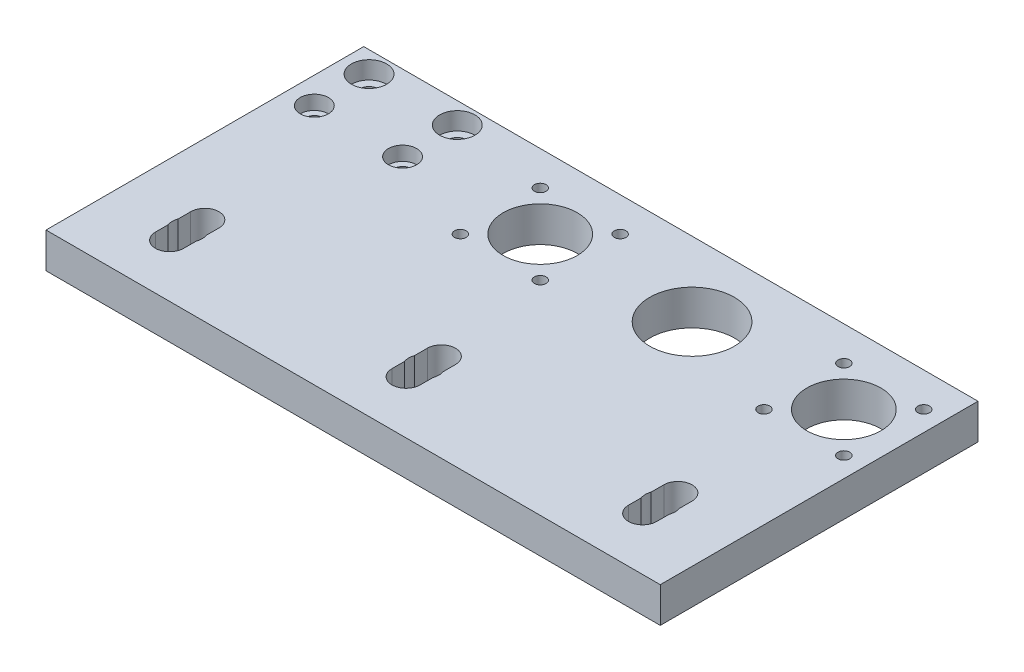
ISO-10303-21;
HEADER;
FILE_DESCRIPTION(('STEP AP214'),'2;1');
FILE_NAME('part.step','',(''),(''),'','','');
FILE_SCHEMA(('AUTOMOTIVE_DESIGN { 1 0 10303 214 1 1 1 1 }'));
ENDSEC;
DATA;
#1=APPLICATION_CONTEXT('core data for automotive mechanical design processes');
#2=APPLICATION_PROTOCOL_DEFINITION('international standard','automotive_design',2000,#1);
#3=PRODUCT_CONTEXT('',#1,'mechanical');
#4=PRODUCT('Part','Part','',(#3));
#5=PRODUCT_RELATED_PRODUCT_CATEGORY('part','',(#4));
#6=PRODUCT_DEFINITION_FORMATION('','',#4);
#7=PRODUCT_DEFINITION_CONTEXT('part definition',#1,'design');
#8=PRODUCT_DEFINITION('design','',#6,#7);
#9=PRODUCT_DEFINITION_SHAPE('','',#8);
#10=(LENGTH_UNIT() NAMED_UNIT(*) SI_UNIT(.MILLI.,.METRE.));
#11=(NAMED_UNIT(*) PLANE_ANGLE_UNIT() SI_UNIT($,.RADIAN.));
#12=(NAMED_UNIT(*) SI_UNIT($,.STERADIAN.) SOLID_ANGLE_UNIT());
#13=UNCERTAINTY_MEASURE_WITH_UNIT(LENGTH_MEASURE(1.E-05),#10,'distance_accuracy_value','');
#14=(GEOMETRIC_REPRESENTATION_CONTEXT(3) GLOBAL_UNCERTAINTY_ASSIGNED_CONTEXT((#13)) GLOBAL_UNIT_ASSIGNED_CONTEXT((#10,
#11,#12)) REPRESENTATION_CONTEXT('',''));
#15=CARTESIAN_POINT('',(0.,0.,0.));
#16=DIRECTION('',(0.,0.,1.));
#17=DIRECTION('',(1.,0.,0.));
#18=AXIS2_PLACEMENT_3D('',#15,#16,#17);
#19=CARTESIAN_POINT('',(-54.5000000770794,5.,-39.0000000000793));
#20=DIRECTION('',(0.,1.,0.));
#21=DIRECTION('',(0.,0.,1.));
#22=AXIS2_PLACEMENT_3D('',#19,#20,#21);
#23=CYLINDRICAL_SURFACE('',#22,5.);
#24=CARTESIAN_POINT('',(-54.5000000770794,10.,-39.0000000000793));
#25=DIRECTION('',(0.,1.,0.));
#26=DIRECTION('',(0.,0.,1.));
#27=AXIS2_PLACEMENT_3D('',#24,#25,#26);
#28=CIRCLE('',#27,5.);
#29=CARTESIAN_POINT('',(-54.5000000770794,10.,-34.0000000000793));
#30=VERTEX_POINT('',#29);
#31=EDGE_CURVE('E440',#30,#30,#28,.F.);
#32=ORIENTED_EDGE('',*,*,#31,.F.);
#33=EDGE_LOOP('',(#32));
#34=FACE_BOUND('',#33,.T.);
#35=CARTESIAN_POINT('',(-54.5000000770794,5.,-39.0000000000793));
#36=DIRECTION('',(0.,1.,0.));
#37=DIRECTION('',(0.,0.,1.));
#38=AXIS2_PLACEMENT_3D('',#35,#36,#37);
#39=CIRCLE('',#38,5.);
#40=CARTESIAN_POINT('',(-54.5000000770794,5.,-34.0000000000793));
#41=VERTEX_POINT('',#40);
#42=EDGE_CURVE('E20',#41,#41,#39,.T.);
#43=ORIENTED_EDGE('',*,*,#42,.F.);
#44=EDGE_LOOP('',(#43));
#45=FACE_BOUND('',#44,.T.);
#46=ADVANCED_FACE('F17',(#34,#45),#23,.F.);
#47=CARTESIAN_POINT('',(-79.5000000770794,5.,-39.0000000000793));
#48=DIRECTION('',(0.,1.,0.));
#49=DIRECTION('',(0.,0.,1.));
#50=AXIS2_PLACEMENT_3D('',#47,#48,#49);
#51=CYLINDRICAL_SURFACE('',#50,5.);
#52=CARTESIAN_POINT('',(-79.5000000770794,10.,-39.0000000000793));
#53=DIRECTION('',(0.,1.,0.));
#54=DIRECTION('',(0.,0.,1.));
#55=AXIS2_PLACEMENT_3D('',#52,#53,#54);
#56=CIRCLE('',#55,5.);
#57=CARTESIAN_POINT('',(-79.5000000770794,10.,-34.0000000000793));
#58=VERTEX_POINT('',#57);
#59=EDGE_CURVE('E437',#58,#58,#56,.F.);
#60=ORIENTED_EDGE('',*,*,#59,.F.);
#61=EDGE_LOOP('',(#60));
#62=FACE_BOUND('',#61,.T.);
#63=CARTESIAN_POINT('',(-79.5000000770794,5.,-39.0000000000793));
#64=DIRECTION('',(0.,1.,0.));
#65=DIRECTION('',(0.,0.,1.));
#66=AXIS2_PLACEMENT_3D('',#63,#64,#65);
#67=CIRCLE('',#66,5.);
#68=CARTESIAN_POINT('',(-79.5000000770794,5.,-34.0000000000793));
#69=VERTEX_POINT('',#68);
#70=EDGE_CURVE('E448',#69,#69,#67,.T.);
#71=ORIENTED_EDGE('',*,*,#70,.F.);
#72=EDGE_LOOP('',(#71));
#73=FACE_BOUND('',#72,.T.);
#74=ADVANCED_FACE('F458',(#62,#73),#51,.F.);
#75=CARTESIAN_POINT('',(-54.5000000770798,6.,-23.5000000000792));
#76=DIRECTION('',(0.,1.,0.));
#77=DIRECTION('',(0.,0.,1.));
#78=AXIS2_PLACEMENT_3D('',#75,#76,#77);
#79=CYLINDRICAL_SURFACE('',#78,4.);
#80=CARTESIAN_POINT('',(-54.5000000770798,10.,-23.5000000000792));
#81=DIRECTION('',(0.,1.,0.));
#82=DIRECTION('',(0.,0.,1.));
#83=AXIS2_PLACEMENT_3D('',#80,#81,#82);
#84=CIRCLE('',#83,4.);
#85=CARTESIAN_POINT('',(-54.5000000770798,10.,-19.5000000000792));
#86=VERTEX_POINT('',#85);
#87=EDGE_CURVE('E434',#86,#86,#84,.F.);
#88=ORIENTED_EDGE('',*,*,#87,.F.);
#89=EDGE_LOOP('',(#88));
#90=FACE_BOUND('',#89,.T.);
#91=CARTESIAN_POINT('',(-54.5000000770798,6.,-23.5000000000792));
#92=DIRECTION('',(0.,1.,0.));
#93=DIRECTION('',(0.,0.,1.));
#94=AXIS2_PLACEMENT_3D('',#91,#92,#93);
#95=CIRCLE('',#94,4.);
#96=CARTESIAN_POINT('',(-54.5000000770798,6.,-19.5000000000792));
#97=VERTEX_POINT('',#96);
#98=EDGE_CURVE('E443',#97,#97,#95,.T.);
#99=ORIENTED_EDGE('',*,*,#98,.F.);
#100=EDGE_LOOP('',(#99));
#101=FACE_BOUND('',#100,.T.);
#102=ADVANCED_FACE('F464',(#90,#101),#79,.F.);
#103=CARTESIAN_POINT('',(-79.5000000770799,6.,-23.5000000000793));
#104=DIRECTION('',(0.,1.,0.));
#105=DIRECTION('',(0.,0.,1.));
#106=AXIS2_PLACEMENT_3D('',#103,#104,#105);
#107=CYLINDRICAL_SURFACE('',#106,4.);
#108=CARTESIAN_POINT('',(-79.5000000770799,10.,-23.5000000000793));
#109=DIRECTION('',(0.,1.,0.));
#110=DIRECTION('',(0.,0.,1.));
#111=AXIS2_PLACEMENT_3D('',#108,#109,#110);
#112=CIRCLE('',#111,4.);
#113=CARTESIAN_POINT('',(-79.5000000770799,10.,-19.5000000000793));
#114=VERTEX_POINT('',#113);
#115=EDGE_CURVE('E218',#114,#114,#112,.F.);
#116=ORIENTED_EDGE('',*,*,#115,.F.);
#117=EDGE_LOOP('',(#116));
#118=FACE_BOUND('',#117,.T.);
#119=CARTESIAN_POINT('',(-79.5000000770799,6.,-23.5000000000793));
#120=DIRECTION('',(0.,1.,0.));
#121=DIRECTION('',(0.,0.,1.));
#122=AXIS2_PLACEMENT_3D('',#119,#120,#121);
#123=CIRCLE('',#122,4.);
#124=CARTESIAN_POINT('',(-79.5000000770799,6.,-19.5000000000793));
#125=VERTEX_POINT('',#124);
#126=EDGE_CURVE('E446',#125,#125,#123,.T.);
#127=ORIENTED_EDGE('',*,*,#126,.F.);
#128=EDGE_LOOP('',(#127));
#129=FACE_BOUND('',#128,.T.);
#130=ADVANCED_FACE('F660',(#118,#129),#107,.F.);
#131=CARTESIAN_POINT('',(-54.5000000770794,5.,-39.0000000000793));
#132=DIRECTION('',(0.,1.,0.));
#133=DIRECTION('',(0.,0.,1.));
#134=AXIS2_PLACEMENT_3D('',#131,#132,#133);
#135=PLANE('',#134);
#136=CARTESIAN_POINT('',(-54.5000000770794,5.,-39.0000000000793));
#137=DIRECTION('',(0.,-1.,0.));
#138=DIRECTION('',(0.,0.,-1.));
#139=AXIS2_PLACEMENT_3D('',#136,#137,#138);
#140=CIRCLE('',#139,2.75);
#141=CARTESIAN_POINT('',(-54.5000000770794,5.,-41.7500000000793));
#142=VERTEX_POINT('',#141);
#143=EDGE_CURVE('E380',#142,#142,#140,.T.);
#144=ORIENTED_EDGE('',*,*,#143,.T.);
#145=EDGE_LOOP('',(#144));
#146=FACE_BOUND('',#145,.T.);
#147=ORIENTED_EDGE('',*,*,#42,.T.);
#148=EDGE_LOOP('',(#147));
#149=FACE_BOUND('',#148,.T.);
#150=ADVANCED_FACE('F455',(#146,#149),#135,.T.);
#151=CARTESIAN_POINT('',(-79.5000000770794,5.,-39.0000000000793));
#152=DIRECTION('',(0.,1.,0.));
#153=DIRECTION('',(0.,0.,1.));
#154=AXIS2_PLACEMENT_3D('',#151,#152,#153);
#155=PLANE('',#154);
#156=CARTESIAN_POINT('',(-79.5000000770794,5.,-39.0000000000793));
#157=DIRECTION('',(0.,-1.,0.));
#158=DIRECTION('',(0.,0.,-1.));
#159=AXIS2_PLACEMENT_3D('',#156,#157,#158);
#160=CIRCLE('',#159,2.75000000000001);
#161=CARTESIAN_POINT('',(-79.5000000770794,5.,-41.7500000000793));
#162=VERTEX_POINT('',#161);
#163=EDGE_CURVE('E377',#162,#162,#160,.T.);
#164=ORIENTED_EDGE('',*,*,#163,.T.);
#165=EDGE_LOOP('',(#164));
#166=FACE_BOUND('',#165,.T.);
#167=ORIENTED_EDGE('',*,*,#70,.T.);
#168=EDGE_LOOP('',(#167));
#169=FACE_BOUND('',#168,.T.);
#170=ADVANCED_FACE('F653',(#166,#169),#155,.T.);
#171=CARTESIAN_POINT('',(-79.5000000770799,6.,-23.5000000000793));
#172=DIRECTION('',(0.,1.,0.));
#173=DIRECTION('',(0.,0.,1.));
#174=AXIS2_PLACEMENT_3D('',#171,#172,#173);
#175=PLANE('',#174);
#176=CARTESIAN_POINT('',(-79.5000000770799,6.,-23.5000000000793));
#177=DIRECTION('',(0.,-1.,0.));
#178=DIRECTION('',(0.,0.,-1.));
#179=AXIS2_PLACEMENT_3D('',#176,#177,#178);
#180=CIRCLE('',#179,2.25);
#181=CARTESIAN_POINT('',(-79.5000000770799,6.,-25.7500000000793));
#182=VERTEX_POINT('',#181);
#183=EDGE_CURVE('E374',#182,#182,#180,.T.);
#184=ORIENTED_EDGE('',*,*,#183,.T.);
#185=EDGE_LOOP('',(#184));
#186=FACE_BOUND('',#185,.T.);
#187=ORIENTED_EDGE('',*,*,#126,.T.);
#188=EDGE_LOOP('',(#187));
#189=FACE_BOUND('',#188,.T.);
#190=ADVANCED_FACE('F649',(#186,#189),#175,.T.);
#191=CARTESIAN_POINT('',(-54.5000000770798,6.,-23.5000000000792));
#192=DIRECTION('',(0.,1.,0.));
#193=DIRECTION('',(0.,0.,1.));
#194=AXIS2_PLACEMENT_3D('',#191,#192,#193);
#195=PLANE('',#194);
#196=CARTESIAN_POINT('',(-54.5000000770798,6.,-23.5000000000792));
#197=DIRECTION('',(0.,-1.,0.));
#198=DIRECTION('',(0.,0.,-1.));
#199=AXIS2_PLACEMENT_3D('',#196,#197,#198);
#200=CIRCLE('',#199,2.25);
#201=CARTESIAN_POINT('',(-54.5000000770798,6.,-25.7500000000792));
#202=VERTEX_POINT('',#201);
#203=EDGE_CURVE('E371',#202,#202,#200,.T.);
#204=ORIENTED_EDGE('',*,*,#203,.T.);
#205=EDGE_LOOP('',(#204));
#206=FACE_BOUND('',#205,.T.);
#207=ORIENTED_EDGE('',*,*,#98,.T.);
#208=EDGE_LOOP('',(#207));
#209=FACE_BOUND('',#208,.T.);
#210=ADVANCED_FACE('F645',(#206,#209),#195,.T.);
#211=CARTESIAN_POINT('',(0.,10.,0.));
#212=DIRECTION('',(0.,1.,0.));
#213=DIRECTION('',(0.,0.,1.));
#214=AXIS2_PLACEMENT_3D('',#211,#212,#213);
#215=PLANE('',#214);
#216=DIRECTION('',(0.,0.,-1.));
#217=VECTOR('',#216,1.);
#218=CARTESIAN_POINT('',(-87.,10.,-45.));
#219=LINE('',#218,#217);
#220=CARTESIAN_POINT('',(-87.,10.,-45.));
#221=VERTEX_POINT('',#220);
#222=CARTESIAN_POINT('',(-87.,10.,45.));
#223=VERTEX_POINT('',#222);
#224=EDGE_CURVE('E754',#221,#223,#219,.F.);
#225=ORIENTED_EDGE('',*,*,#224,.T.);
#226=DIRECTION('',(-1.,0.,0.));
#227=VECTOR('',#226,1.);
#228=CARTESIAN_POINT('',(-87.,10.,45.));
#229=LINE('',#228,#227);
#230=CARTESIAN_POINT('',(87.,10.,45.));
#231=VERTEX_POINT('',#230);
#232=EDGE_CURVE('E749',#223,#231,#229,.F.);
#233=ORIENTED_EDGE('',*,*,#232,.T.);
#234=DIRECTION('',(0.,0.,1.));
#235=VECTOR('',#234,1.);
#236=CARTESIAN_POINT('',(87.,10.,-45.));
#237=LINE('',#236,#235);
#238=CARTESIAN_POINT('',(87.,10.,-45.));
#239=VERTEX_POINT('',#238);
#240=EDGE_CURVE('E745',#231,#239,#237,.F.);
#241=ORIENTED_EDGE('',*,*,#240,.T.);
#242=DIRECTION('',(1.,0.,0.));
#243=VECTOR('',#242,1.);
#244=CARTESIAN_POINT('',(-87.,10.,-45.));
#245=LINE('',#244,#243);
#246=EDGE_CURVE('E364',#239,#221,#245,.F.);
#247=ORIENTED_EDGE('',*,*,#246,.T.);
#248=EDGE_LOOP('',(#225,#233,#241,#247));
#249=FACE_BOUND('',#248,.T.);
#250=CARTESIAN_POINT('',(70.0000000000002,10.,-24.0000000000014));
#251=DIRECTION('',(0.,-1.,0.));
#252=DIRECTION('',(0.,0.,-1.));
#253=AXIS2_PLACEMENT_3D('',#250,#251,#252);
#254=CIRCLE('',#253,10.5);
#255=CARTESIAN_POINT('',(70.0000000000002,10.,-34.5000000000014));
#256=VERTEX_POINT('',#255);
#257=EDGE_CURVE('E361',#256,#256,#254,.T.);
#258=ORIENTED_EDGE('',*,*,#257,.T.);
#259=EDGE_LOOP('',(#258));
#260=FACE_BOUND('',#259,.T.);
#261=CARTESIAN_POINT('',(26.9999999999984,10.,-24.0000000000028));
#262=DIRECTION('',(0.,-1.,0.));
#263=DIRECTION('',(0.,0.,-1.));
#264=AXIS2_PLACEMENT_3D('',#261,#262,#263);
#265=CIRCLE('',#264,12.);
#266=CARTESIAN_POINT('',(26.9999999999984,10.,-36.0000000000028));
#267=VERTEX_POINT('',#266);
#268=EDGE_CURVE('E365',#267,#267,#265,.T.);
#269=ORIENTED_EDGE('',*,*,#268,.T.);
#270=EDGE_LOOP('',(#269));
#271=FACE_BOUND('',#270,.T.);
#272=CARTESIAN_POINT('',(-15.9999999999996,10.,-24.0000000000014));
#273=DIRECTION('',(0.,-1.,0.));
#274=DIRECTION('',(0.,0.,-1.));
#275=AXIS2_PLACEMENT_3D('',#272,#273,#274);
#276=CIRCLE('',#275,10.5);
#277=CARTESIAN_POINT('',(-15.9999999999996,10.,-34.5000000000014));
#278=VERTEX_POINT('',#277);
#279=EDGE_CURVE('E368',#278,#278,#276,.T.);
#280=ORIENTED_EDGE('',*,*,#279,.T.);
#281=EDGE_LOOP('',(#280));
#282=FACE_BOUND('',#281,.T.);
#283=ORIENTED_EDGE('',*,*,#115,.T.);
#284=EDGE_LOOP('',(#283));
#285=FACE_BOUND('',#284,.T.);
#286=ORIENTED_EDGE('',*,*,#87,.T.);
#287=EDGE_LOOP('',(#286));
#288=FACE_BOUND('',#287,.T.);
#289=ORIENTED_EDGE('',*,*,#59,.T.);
#290=EDGE_LOOP('',(#289));
#291=FACE_BOUND('',#290,.T.);
#292=ORIENTED_EDGE('',*,*,#31,.T.);
#293=EDGE_LOOP('',(#292));
#294=FACE_BOUND('',#293,.T.);
#295=CARTESIAN_POINT('',(58.6862915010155,10.,-12.6862915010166));
#296=DIRECTION('',(0.,1.,0.));
#297=DIRECTION('',(0.,0.,1.));
#298=AXIS2_PLACEMENT_3D('',#295,#296,#297);
#299=CIRCLE('',#298,1.64999999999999);
#300=CARTESIAN_POINT('',(58.6862915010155,10.,-11.0362915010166));
#301=VERTEX_POINT('',#300);
#302=EDGE_CURVE('E383',#301,#301,#299,.F.);
#303=ORIENTED_EDGE('',*,*,#302,.T.);
#304=EDGE_LOOP('',(#303));
#305=FACE_BOUND('',#304,.T.);
#306=CARTESIAN_POINT('',(58.6862915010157,10.,-35.3137084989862));
#307=DIRECTION('',(0.,1.,0.));
#308=DIRECTION('',(0.,0.,1.));
#309=AXIS2_PLACEMENT_3D('',#306,#307,#308);
#310=CIRCLE('',#309,1.64999999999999);
#311=CARTESIAN_POINT('',(58.6862915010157,10.,-33.6637084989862));
#312=VERTEX_POINT('',#311);
#313=EDGE_CURVE('E386',#312,#312,#310,.F.);
#314=ORIENTED_EDGE('',*,*,#313,.T.);
#315=EDGE_LOOP('',(#314));
#316=FACE_BOUND('',#315,.T.);
#317=CARTESIAN_POINT('',(81.3137084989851,10.,-12.6862915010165));
#318=DIRECTION('',(0.,1.,0.));
#319=DIRECTION('',(0.,0.,1.));
#320=AXIS2_PLACEMENT_3D('',#317,#318,#319);
#321=CIRCLE('',#320,1.64999999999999);
#322=CARTESIAN_POINT('',(81.3137084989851,10.,-11.0362915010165));
#323=VERTEX_POINT('',#322);
#324=EDGE_CURVE('E389',#323,#323,#321,.F.);
#325=ORIENTED_EDGE('',*,*,#324,.T.);
#326=EDGE_LOOP('',(#325));
#327=FACE_BOUND('',#326,.T.);
#328=CARTESIAN_POINT('',(81.3137084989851,10.,-35.3137084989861));
#329=DIRECTION('',(0.,1.,0.));
#330=DIRECTION('',(0.,0.,1.));
#331=AXIS2_PLACEMENT_3D('',#328,#329,#330);
#332=CIRCLE('',#331,1.64999999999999);
#333=CARTESIAN_POINT('',(81.3137084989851,10.,-33.6637084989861));
#334=VERTEX_POINT('',#333);
#335=EDGE_CURVE('E392',#334,#334,#332,.F.);
#336=ORIENTED_EDGE('',*,*,#335,.T.);
#337=EDGE_LOOP('',(#336));
#338=FACE_BOUND('',#337,.T.);
#339=CARTESIAN_POINT('',(-27.3137084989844,10.,-12.6862915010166));
#340=DIRECTION('',(0.,1.,0.));
#341=DIRECTION('',(0.,0.,1.));
#342=AXIS2_PLACEMENT_3D('',#339,#340,#341);
#343=CIRCLE('',#342,1.64999999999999);
#344=CARTESIAN_POINT('',(-27.3137084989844,10.,-11.0362915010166));
#345=VERTEX_POINT('',#344);
#346=EDGE_CURVE('E395',#345,#345,#343,.F.);
#347=ORIENTED_EDGE('',*,*,#346,.T.);
#348=EDGE_LOOP('',(#347));
#349=FACE_BOUND('',#348,.T.);
#350=CARTESIAN_POINT('',(-27.3137084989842,10.,-35.3137084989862));
#351=DIRECTION('',(0.,1.,0.));
#352=DIRECTION('',(0.,0.,1.));
#353=AXIS2_PLACEMENT_3D('',#350,#351,#352);
#354=CIRCLE('',#353,1.64999999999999);
#355=CARTESIAN_POINT('',(-27.3137084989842,10.,-33.6637084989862));
#356=VERTEX_POINT('',#355);
#357=EDGE_CURVE('E398',#356,#356,#354,.F.);
#358=ORIENTED_EDGE('',*,*,#357,.T.);
#359=EDGE_LOOP('',(#358));
#360=FACE_BOUND('',#359,.T.);
#361=CARTESIAN_POINT('',(-4.68629150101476,10.,-35.3137084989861));
#362=DIRECTION('',(0.,1.,0.));
#363=DIRECTION('',(0.,0.,1.));
#364=AXIS2_PLACEMENT_3D('',#361,#362,#363);
#365=CIRCLE('',#364,1.64999999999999);
#366=CARTESIAN_POINT('',(-4.68629150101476,10.,-33.6637084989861));
#367=VERTEX_POINT('',#366);
#368=EDGE_CURVE('E401',#367,#367,#365,.F.);
#369=ORIENTED_EDGE('',*,*,#368,.T.);
#370=EDGE_LOOP('',(#369));
#371=FACE_BOUND('',#370,.T.);
#372=CARTESIAN_POINT('',(-4.6862915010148,10.,-12.6862915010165));
#373=DIRECTION('',(0.,1.,0.));
#374=DIRECTION('',(0.,0.,1.));
#375=AXIS2_PLACEMENT_3D('',#372,#373,#374);
#376=CIRCLE('',#375,1.64999999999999);
#377=CARTESIAN_POINT('',(-4.6862915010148,10.,-11.0362915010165));
#378=VERTEX_POINT('',#377);
#379=EDGE_CURVE('E404',#378,#378,#376,.F.);
#380=ORIENTED_EDGE('',*,*,#379,.T.);
#381=EDGE_LOOP('',(#380));
#382=FACE_BOUND('',#381,.T.);
#383=DIRECTION('',(0.,0.,1.));
#384=VECTOR('',#383,1.);
#385=CARTESIAN_POINT('',(-71.,10.,20.));
#386=LINE('',#385,#384);
#387=CARTESIAN_POINT('',(-71.,10.,23.5638593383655));
#388=VERTEX_POINT('',#387);
#389=CARTESIAN_POINT('',(-71.,10.,20.));
#390=VERTEX_POINT('',#389);
#391=EDGE_CURVE('E236',#388,#390,#386,.F.);
#392=ORIENTED_EDGE('',*,*,#391,.T.);
#393=CARTESIAN_POINT('',(-67.,10.,20.));
#394=DIRECTION('',(0.,1.,0.));
#395=DIRECTION('',(0.,0.,1.));
#396=AXIS2_PLACEMENT_3D('',#393,#394,#395);
#397=CIRCLE('',#396,4.00000000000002);
#398=CARTESIAN_POINT('',(-63.,10.,20.));
#399=VERTEX_POINT('',#398);
#400=EDGE_CURVE('E411',#390,#399,#397,.F.);
#401=ORIENTED_EDGE('',*,*,#400,.T.);
#402=DIRECTION('',(0.,0.,-1.));
#403=VECTOR('',#402,1.);
#404=CARTESIAN_POINT('',(-63.,10.,20.));
#405=LINE('',#404,#403);
#406=CARTESIAN_POINT('',(-63.,10.,23.5638593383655));
#407=VERTEX_POINT('',#406);
#408=EDGE_CURVE('E227',#399,#407,#405,.F.);
#409=ORIENTED_EDGE('',*,*,#408,.T.);
#410=CARTESIAN_POINT('',(-67.,10.,25.));
#411=DIRECTION('',(0.,1.,0.));
#412=DIRECTION('',(0.,0.,1.));
#413=AXIS2_PLACEMENT_3D('',#410,#411,#412);
#414=CIRCLE('',#413,4.25);
#415=CARTESIAN_POINT('',(-63.,10.,26.4361406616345));
#416=VERTEX_POINT('',#415);
#417=EDGE_CURVE('E407',#407,#416,#414,.F.);
#418=ORIENTED_EDGE('',*,*,#417,.T.);
#419=DIRECTION('',(0.,0.,-1.));
#420=VECTOR('',#419,1.);
#421=CARTESIAN_POINT('',(-63.,10.,20.));
#422=LINE('',#421,#420);
#423=CARTESIAN_POINT('',(-63.,10.,30.));
#424=VERTEX_POINT('',#423);
#425=EDGE_CURVE('E231',#416,#424,#422,.F.);
#426=ORIENTED_EDGE('',*,*,#425,.T.);
#427=CARTESIAN_POINT('',(-67.,10.,30.));
#428=DIRECTION('',(0.,1.,0.));
#429=DIRECTION('',(0.,0.,1.));
#430=AXIS2_PLACEMENT_3D('',#427,#428,#429);
#431=CIRCLE('',#430,4.00000000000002);
#432=CARTESIAN_POINT('',(-71.,10.,30.));
#433=VERTEX_POINT('',#432);
#434=EDGE_CURVE('E415',#424,#433,#431,.F.);
#435=ORIENTED_EDGE('',*,*,#434,.T.);
#436=DIRECTION('',(0.,0.,1.));
#437=VECTOR('',#436,1.);
#438=CARTESIAN_POINT('',(-71.,10.,20.));
#439=LINE('',#438,#437);
#440=CARTESIAN_POINT('',(-71.,10.,26.4361406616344));
#441=VERTEX_POINT('',#440);
#442=EDGE_CURVE('E240',#433,#441,#439,.F.);
#443=ORIENTED_EDGE('',*,*,#442,.T.);
#444=CARTESIAN_POINT('',(-67.,10.,25.));
#445=DIRECTION('',(0.,1.,0.));
#446=DIRECTION('',(0.,0.,1.));
#447=AXIS2_PLACEMENT_3D('',#444,#445,#446);
#448=CIRCLE('',#447,4.25);
#449=EDGE_CURVE('E413',#441,#388,#448,.F.);
#450=ORIENTED_EDGE('',*,*,#449,.T.);
#451=EDGE_LOOP('',(#392,#401,#409,#418,#426,#435,#443,#450));
#452=FACE_BOUND('',#451,.T.);
#453=DIRECTION('',(0.,0.,1.));
#454=VECTOR('',#453,1.);
#455=CARTESIAN_POINT('',(-4.,10.,20.));
#456=LINE('',#455,#454);
#457=CARTESIAN_POINT('',(-4.,10.,23.5638593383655));
#458=VERTEX_POINT('',#457);
#459=CARTESIAN_POINT('',(-4.,10.,20.));
#460=VERTEX_POINT('',#459);
#461=EDGE_CURVE('E252',#458,#460,#456,.F.);
#462=ORIENTED_EDGE('',*,*,#461,.T.);
#463=CARTESIAN_POINT('',(0.,10.,20.));
#464=DIRECTION('',(0.,1.,0.));
#465=DIRECTION('',(0.,0.,1.));
#466=AXIS2_PLACEMENT_3D('',#463,#464,#465);
#467=CIRCLE('',#466,4.);
#468=CARTESIAN_POINT('',(4.,10.,20.));
#469=VERTEX_POINT('',#468);
#470=EDGE_CURVE('E420',#460,#469,#467,.F.);
#471=ORIENTED_EDGE('',*,*,#470,.T.);
#472=DIRECTION('',(0.,0.,-1.));
#473=VECTOR('',#472,1.);
#474=CARTESIAN_POINT('',(4.,10.,20.));
#475=LINE('',#474,#473);
#476=CARTESIAN_POINT('',(4.,10.,23.5638593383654));
#477=VERTEX_POINT('',#476);
#478=EDGE_CURVE('E244',#469,#477,#475,.F.);
#479=ORIENTED_EDGE('',*,*,#478,.T.);
#480=CARTESIAN_POINT('',(0.,10.,25.));
#481=DIRECTION('',(0.,1.,0.));
#482=DIRECTION('',(0.,0.,1.));
#483=AXIS2_PLACEMENT_3D('',#480,#481,#482);
#484=CIRCLE('',#483,4.25);
#485=CARTESIAN_POINT('',(4.,10.,26.4361406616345));
#486=VERTEX_POINT('',#485);
#487=EDGE_CURVE('E235',#477,#486,#484,.F.);
#488=ORIENTED_EDGE('',*,*,#487,.T.);
#489=DIRECTION('',(0.,0.,-1.));
#490=VECTOR('',#489,1.);
#491=CARTESIAN_POINT('',(4.,10.,20.));
#492=LINE('',#491,#490);
#493=CARTESIAN_POINT('',(4.,10.,30.));
#494=VERTEX_POINT('',#493);
#495=EDGE_CURVE('E248',#486,#494,#492,.F.);
#496=ORIENTED_EDGE('',*,*,#495,.T.);
#497=CARTESIAN_POINT('',(0.,10.,30.));
#498=DIRECTION('',(0.,1.,0.));
#499=DIRECTION('',(0.,0.,1.));
#500=AXIS2_PLACEMENT_3D('',#497,#498,#499);
#501=CIRCLE('',#500,4.);
#502=CARTESIAN_POINT('',(-4.,10.,30.));
#503=VERTEX_POINT('',#502);
#504=EDGE_CURVE('E424',#494,#503,#501,.F.);
#505=ORIENTED_EDGE('',*,*,#504,.T.);
#506=DIRECTION('',(0.,0.,1.));
#507=VECTOR('',#506,1.);
#508=CARTESIAN_POINT('',(-4.,10.,20.));
#509=LINE('',#508,#507);
#510=CARTESIAN_POINT('',(-4.,10.,26.4361406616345));
#511=VERTEX_POINT('',#510);
#512=EDGE_CURVE('E256',#503,#511,#509,.F.);
#513=ORIENTED_EDGE('',*,*,#512,.T.);
#514=CARTESIAN_POINT('',(0.,10.,25.));
#515=DIRECTION('',(0.,1.,0.));
#516=DIRECTION('',(0.,0.,1.));
#517=AXIS2_PLACEMENT_3D('',#514,#515,#516);
#518=CIRCLE('',#517,4.25);
#519=EDGE_CURVE('E422',#511,#458,#518,.F.);
#520=ORIENTED_EDGE('',*,*,#519,.T.);
#521=EDGE_LOOP('',(#462,#471,#479,#488,#496,#505,#513,#520));
#522=FACE_BOUND('',#521,.T.);
#523=DIRECTION('',(0.,0.,1.));
#524=VECTOR('',#523,1.);
#525=CARTESIAN_POINT('',(63.,10.,20.));
#526=LINE('',#525,#524);
#527=CARTESIAN_POINT('',(63.,10.,23.5638593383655));
#528=VERTEX_POINT('',#527);
#529=CARTESIAN_POINT('',(63.,10.,20.));
#530=VERTEX_POINT('',#529);
#531=EDGE_CURVE('E264',#528,#530,#526,.F.);
#532=ORIENTED_EDGE('',*,*,#531,.T.);
#533=CARTESIAN_POINT('',(67.,10.,20.));
#534=DIRECTION('',(0.,1.,0.));
#535=DIRECTION('',(0.,0.,1.));
#536=AXIS2_PLACEMENT_3D('',#533,#534,#535);
#537=CIRCLE('',#536,3.99999999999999);
#538=CARTESIAN_POINT('',(71.,10.,20.));
#539=VERTEX_POINT('',#538);
#540=EDGE_CURVE('E428',#530,#539,#537,.F.);
#541=ORIENTED_EDGE('',*,*,#540,.T.);
#542=DIRECTION('',(0.,0.,-1.));
#543=VECTOR('',#542,1.);
#544=CARTESIAN_POINT('',(71.,10.,20.));
#545=LINE('',#544,#543);
#546=CARTESIAN_POINT('',(71.,10.,23.5638593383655));
#547=VERTEX_POINT('',#546);
#548=EDGE_CURVE('E260',#539,#547,#545,.F.);
#549=ORIENTED_EDGE('',*,*,#548,.T.);
#550=CARTESIAN_POINT('',(67.,10.,25.));
#551=DIRECTION('',(0.,1.,0.));
#552=DIRECTION('',(0.,0.,1.));
#553=AXIS2_PLACEMENT_3D('',#550,#551,#552);
#554=CIRCLE('',#553,4.25);
#555=CARTESIAN_POINT('',(71.,10.,26.4361406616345));
#556=VERTEX_POINT('',#555);
#557=EDGE_CURVE('E214',#547,#556,#554,.F.);
#558=ORIENTED_EDGE('',*,*,#557,.T.);
#559=DIRECTION('',(0.,0.,-1.));
#560=VECTOR('',#559,1.);
#561=CARTESIAN_POINT('',(71.,10.,20.));
#562=LINE('',#561,#560);
#563=CARTESIAN_POINT('',(71.,10.,30.));
#564=VERTEX_POINT('',#563);
#565=EDGE_CURVE('E211',#556,#564,#562,.F.);
#566=ORIENTED_EDGE('',*,*,#565,.T.);
#567=CARTESIAN_POINT('',(67.,10.,30.));
#568=DIRECTION('',(0.,1.,0.));
#569=DIRECTION('',(0.,0.,1.));
#570=AXIS2_PLACEMENT_3D('',#567,#568,#569);
#571=CIRCLE('',#570,3.99999999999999);
#572=CARTESIAN_POINT('',(63.,10.,30.));
#573=VERTEX_POINT('',#572);
#574=EDGE_CURVE('E199',#564,#573,#571,.F.);
#575=ORIENTED_EDGE('',*,*,#574,.T.);
#576=DIRECTION('',(0.,0.,1.));
#577=VECTOR('',#576,1.);
#578=CARTESIAN_POINT('',(63.,10.,20.));
#579=LINE('',#578,#577);
#580=CARTESIAN_POINT('',(63.,10.,26.4361406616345));
#581=VERTEX_POINT('',#580);
#582=EDGE_CURVE('E268',#573,#581,#579,.F.);
#583=ORIENTED_EDGE('',*,*,#582,.T.);
#584=CARTESIAN_POINT('',(67.,10.,25.));
#585=DIRECTION('',(0.,1.,0.));
#586=DIRECTION('',(0.,0.,1.));
#587=AXIS2_PLACEMENT_3D('',#584,#585,#586);
#588=CIRCLE('',#587,4.25);
#589=EDGE_CURVE('E430',#581,#528,#588,.F.);
#590=ORIENTED_EDGE('',*,*,#589,.T.);
#591=EDGE_LOOP('',(#532,#541,#549,#558,#566,#575,#583,#590));
#592=FACE_BOUND('',#591,.T.);
#593=ADVANCED_FACE('F212',(#249,#260,#271,#282,#285,#288,#291,#294,#305,#316,#327,#338,#349,
#360,#371,#382,#452,#522,#592),#215,.T.);
#594=CARTESIAN_POINT('',(71.,0.,20.));
#595=DIRECTION('',(1.,0.,0.));
#596=DIRECTION('',(0.,0.,-1.));
#597=AXIS2_PLACEMENT_3D('',#594,#595,#596);
#598=PLANE('',#597);
#599=DIRECTION('',(0.,1.,0.));
#600=VECTOR('',#599,1.);
#601=CARTESIAN_POINT('',(71.,0.,30.));
#602=LINE('',#601,#600);
#603=CARTESIAN_POINT('',(71.,0.,30.));
#604=VERTEX_POINT('',#603);
#605=EDGE_CURVE('E205',#604,#564,#602,.T.);
#606=ORIENTED_EDGE('',*,*,#605,.T.);
#607=ORIENTED_EDGE('',*,*,#565,.F.);
#608=DIRECTION('',(0.,1.,0.));
#609=VECTOR('',#608,1.);
#610=CARTESIAN_POINT('',(71.,0.,26.4361406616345));
#611=LINE('',#610,#609);
#612=CARTESIAN_POINT('',(71.,0.,26.4361406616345));
#613=VERTEX_POINT('',#612);
#614=EDGE_CURVE('E261',#556,#613,#611,.F.);
#615=ORIENTED_EDGE('',*,*,#614,.T.);
#616=DIRECTION('',(0.,0.,1.));
#617=VECTOR('',#616,1.);
#618=CARTESIAN_POINT('',(71.,0.,0.));
#619=LINE('',#618,#617);
#620=EDGE_CURVE('E222',#613,#604,#619,.T.);
#621=ORIENTED_EDGE('',*,*,#620,.T.);
#622=EDGE_LOOP('',(#606,#607,#615,#621));
#623=FACE_BOUND('',#622,.T.);
#624=ADVANCED_FACE('F221',(#623),#598,.F.);
#625=CARTESIAN_POINT('',(67.,0.,30.));
#626=DIRECTION('',(0.,1.,0.));
#627=DIRECTION('',(0.,0.,1.));
#628=AXIS2_PLACEMENT_3D('',#625,#626,#627);
#629=CYLINDRICAL_SURFACE('',#628,3.99999999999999);
#630=CARTESIAN_POINT('',(67.,0.,30.));
#631=DIRECTION('',(0.,1.,0.));
#632=DIRECTION('',(0.,0.,1.));
#633=AXIS2_PLACEMENT_3D('',#630,#631,#632);
#634=CIRCLE('',#633,3.99999999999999);
#635=CARTESIAN_POINT('',(63.,0.,30.));
#636=VERTEX_POINT('',#635);
#637=EDGE_CURVE('E359',#604,#636,#634,.F.);
#638=ORIENTED_EDGE('',*,*,#637,.T.);
#639=DIRECTION('',(0.,1.,0.));
#640=VECTOR('',#639,1.);
#641=CARTESIAN_POINT('',(63.,0.,30.));
#642=LINE('',#641,#640);
#643=EDGE_CURVE('E208',#636,#573,#642,.T.);
#644=ORIENTED_EDGE('',*,*,#643,.T.);
#645=ORIENTED_EDGE('',*,*,#574,.F.);
#646=ORIENTED_EDGE('',*,*,#605,.F.);
#647=EDGE_LOOP('',(#638,#644,#645,#646));
#648=FACE_BOUND('',#647,.T.);
#649=ADVANCED_FACE('F203',(#648),#629,.F.);
#650=CARTESIAN_POINT('',(63.,0.,20.));
#651=DIRECTION('',(-1.,0.,0.));
#652=DIRECTION('',(0.,0.,1.));
#653=AXIS2_PLACEMENT_3D('',#650,#651,#652);
#654=PLANE('',#653);
#655=ORIENTED_EDGE('',*,*,#643,.F.);
#656=DIRECTION('',(0.,0.,1.));
#657=VECTOR('',#656,1.);
#658=CARTESIAN_POINT('',(63.,0.,0.));
#659=LINE('',#658,#657);
#660=CARTESIAN_POINT('',(63.,0.,26.4361406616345));
#661=VERTEX_POINT('',#660);
#662=EDGE_CURVE('E358',#636,#661,#659,.F.);
#663=ORIENTED_EDGE('',*,*,#662,.T.);
#664=DIRECTION('',(0.,1.,0.));
#665=VECTOR('',#664,1.);
#666=CARTESIAN_POINT('',(63.,0.,26.4361406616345));
#667=LINE('',#666,#665);
#668=EDGE_CURVE('E270',#661,#581,#667,.T.);
#669=ORIENTED_EDGE('',*,*,#668,.T.);
#670=ORIENTED_EDGE('',*,*,#582,.F.);
#671=EDGE_LOOP('',(#655,#663,#669,#670));
#672=FACE_BOUND('',#671,.T.);
#673=ADVANCED_FACE('F634',(#672),#654,.F.);
#674=CARTESIAN_POINT('',(67.,0.,25.));
#675=DIRECTION('',(0.,1.,0.));
#676=DIRECTION('',(0.,0.,1.));
#677=AXIS2_PLACEMENT_3D('',#674,#675,#676);
#678=CYLINDRICAL_SURFACE('',#677,4.25);
#679=ORIENTED_EDGE('',*,*,#668,.F.);
#680=CARTESIAN_POINT('',(67.,0.,25.));
#681=DIRECTION('',(0.,1.,0.));
#682=DIRECTION('',(0.,0.,1.));
#683=AXIS2_PLACEMENT_3D('',#680,#681,#682);
#684=CIRCLE('',#683,4.25);
#685=CARTESIAN_POINT('',(63.,0.,23.5638593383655));
#686=VERTEX_POINT('',#685);
#687=EDGE_CURVE('E355',#661,#686,#684,.F.);
#688=ORIENTED_EDGE('',*,*,#687,.T.);
#689=DIRECTION('',(0.,1.,0.));
#690=VECTOR('',#689,1.);
#691=CARTESIAN_POINT('',(63.,0.,23.5638593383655));
#692=LINE('',#691,#690);
#693=EDGE_CURVE('E267',#686,#528,#692,.T.);
#694=ORIENTED_EDGE('',*,*,#693,.T.);
#695=ORIENTED_EDGE('',*,*,#589,.F.);
#696=EDGE_LOOP('',(#679,#688,#694,#695));
#697=FACE_BOUND('',#696,.T.);
#698=ADVANCED_FACE('F630',(#697),#678,.F.);
#699=CARTESIAN_POINT('',(63.,0.,20.));
#700=DIRECTION('',(-1.,0.,0.));
#701=DIRECTION('',(0.,0.,1.));
#702=AXIS2_PLACEMENT_3D('',#699,#700,#701);
#703=PLANE('',#702);
#704=DIRECTION('',(0.,1.,0.));
#705=VECTOR('',#704,1.);
#706=CARTESIAN_POINT('',(63.,0.,20.));
#707=LINE('',#706,#705);
#708=CARTESIAN_POINT('',(63.,0.,20.));
#709=VERTEX_POINT('',#708);
#710=EDGE_CURVE('E266',#709,#530,#707,.T.);
#711=ORIENTED_EDGE('',*,*,#710,.T.);
#712=ORIENTED_EDGE('',*,*,#531,.F.);
#713=ORIENTED_EDGE('',*,*,#693,.F.);
#714=DIRECTION('',(0.,0.,1.));
#715=VECTOR('',#714,1.);
#716=CARTESIAN_POINT('',(63.,0.,0.));
#717=LINE('',#716,#715);
#718=EDGE_CURVE('E354',#686,#709,#717,.F.);
#719=ORIENTED_EDGE('',*,*,#718,.T.);
#720=EDGE_LOOP('',(#711,#712,#713,#719));
#721=FACE_BOUND('',#720,.T.);
#722=ADVANCED_FACE('F626',(#721),#703,.F.);
#723=CARTESIAN_POINT('',(67.,0.,20.));
#724=DIRECTION('',(0.,1.,0.));
#725=DIRECTION('',(0.,0.,1.));
#726=AXIS2_PLACEMENT_3D('',#723,#724,#725);
#727=CYLINDRICAL_SURFACE('',#726,3.99999999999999);
#728=ORIENTED_EDGE('',*,*,#710,.F.);
#729=CARTESIAN_POINT('',(67.,0.,20.));
#730=DIRECTION('',(0.,1.,0.));
#731=DIRECTION('',(0.,0.,1.));
#732=AXIS2_PLACEMENT_3D('',#729,#730,#731);
#733=CIRCLE('',#732,3.99999999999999);
#734=CARTESIAN_POINT('',(71.,0.,20.));
#735=VERTEX_POINT('',#734);
#736=EDGE_CURVE('E351',#709,#735,#733,.F.);
#737=ORIENTED_EDGE('',*,*,#736,.T.);
#738=DIRECTION('',(0.,1.,0.));
#739=VECTOR('',#738,1.);
#740=CARTESIAN_POINT('',(71.,0.,20.));
#741=LINE('',#740,#739);
#742=EDGE_CURVE('E262',#735,#539,#741,.T.);
#743=ORIENTED_EDGE('',*,*,#742,.T.);
#744=ORIENTED_EDGE('',*,*,#540,.F.);
#745=EDGE_LOOP('',(#728,#737,#743,#744));
#746=FACE_BOUND('',#745,.T.);
#747=ADVANCED_FACE('F622',(#746),#727,.F.);
#748=CARTESIAN_POINT('',(71.,0.,20.));
#749=DIRECTION('',(1.,0.,0.));
#750=DIRECTION('',(0.,0.,-1.));
#751=AXIS2_PLACEMENT_3D('',#748,#749,#750);
#752=PLANE('',#751);
#753=ORIENTED_EDGE('',*,*,#742,.F.);
#754=DIRECTION('',(0.,0.,1.));
#755=VECTOR('',#754,1.);
#756=CARTESIAN_POINT('',(71.,0.,0.));
#757=LINE('',#756,#755);
#758=CARTESIAN_POINT('',(71.,0.,23.5638593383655));
#759=VERTEX_POINT('',#758);
#760=EDGE_CURVE('E350',#735,#759,#757,.T.);
#761=ORIENTED_EDGE('',*,*,#760,.T.);
#762=DIRECTION('',(0.,1.,0.));
#763=VECTOR('',#762,1.);
#764=CARTESIAN_POINT('',(71.,0.,23.5638593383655));
#765=LINE('',#764,#763);
#766=EDGE_CURVE('E427',#759,#547,#765,.T.);
#767=ORIENTED_EDGE('',*,*,#766,.T.);
#768=ORIENTED_EDGE('',*,*,#548,.F.);
#769=EDGE_LOOP('',(#753,#761,#767,#768));
#770=FACE_BOUND('',#769,.T.);
#771=ADVANCED_FACE('F618',(#770),#752,.F.);
#772=CARTESIAN_POINT('',(67.,0.,25.));
#773=DIRECTION('',(0.,1.,0.));
#774=DIRECTION('',(0.,0.,1.));
#775=AXIS2_PLACEMENT_3D('',#772,#773,#774);
#776=CYLINDRICAL_SURFACE('',#775,4.25);
#777=ORIENTED_EDGE('',*,*,#766,.F.);
#778=CARTESIAN_POINT('',(67.,0.,25.));
#779=DIRECTION('',(0.,1.,0.));
#780=DIRECTION('',(0.,0.,1.));
#781=AXIS2_PLACEMENT_3D('',#778,#779,#780);
#782=CIRCLE('',#781,4.25);
#783=EDGE_CURVE('E347',#759,#613,#782,.F.);
#784=ORIENTED_EDGE('',*,*,#783,.T.);
#785=ORIENTED_EDGE('',*,*,#614,.F.);
#786=ORIENTED_EDGE('',*,*,#557,.F.);
#787=EDGE_LOOP('',(#777,#784,#785,#786));
#788=FACE_BOUND('',#787,.T.);
#789=ADVANCED_FACE('F614',(#788),#776,.F.);
#790=CARTESIAN_POINT('',(4.,0.,20.));
#791=DIRECTION('',(1.,0.,0.));
#792=DIRECTION('',(0.,0.,-1.));
#793=AXIS2_PLACEMENT_3D('',#790,#791,#792);
#794=PLANE('',#793);
#795=DIRECTION('',(0.,1.,0.));
#796=VECTOR('',#795,1.);
#797=CARTESIAN_POINT('',(4.,0.,30.));
#798=LINE('',#797,#796);
#799=CARTESIAN_POINT('',(4.,0.,30.));
#800=VERTEX_POINT('',#799);
#801=EDGE_CURVE('E251',#800,#494,#798,.T.);
#802=ORIENTED_EDGE('',*,*,#801,.T.);
#803=ORIENTED_EDGE('',*,*,#495,.F.);
#804=DIRECTION('',(0.,1.,0.));
#805=VECTOR('',#804,1.);
#806=CARTESIAN_POINT('',(4.,0.,26.4361406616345));
#807=LINE('',#806,#805);
#808=CARTESIAN_POINT('',(4.,0.,26.4361406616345));
#809=VERTEX_POINT('',#808);
#810=EDGE_CURVE('E246',#486,#809,#807,.F.);
#811=ORIENTED_EDGE('',*,*,#810,.T.);
#812=DIRECTION('',(0.,0.,1.));
#813=VECTOR('',#812,1.);
#814=CARTESIAN_POINT('',(4.,0.,0.));
#815=LINE('',#814,#813);
#816=EDGE_CURVE('E346',#809,#800,#815,.T.);
#817=ORIENTED_EDGE('',*,*,#816,.T.);
#818=EDGE_LOOP('',(#802,#803,#811,#817));
#819=FACE_BOUND('',#818,.T.);
#820=ADVANCED_FACE('F610',(#819),#794,.F.);
#821=CARTESIAN_POINT('',(0.,0.,30.));
#822=DIRECTION('',(0.,1.,0.));
#823=DIRECTION('',(0.,0.,1.));
#824=AXIS2_PLACEMENT_3D('',#821,#822,#823);
#825=CYLINDRICAL_SURFACE('',#824,4.);
#826=CARTESIAN_POINT('',(0.,0.,30.));
#827=DIRECTION('',(0.,1.,0.));
#828=DIRECTION('',(0.,0.,1.));
#829=AXIS2_PLACEMENT_3D('',#826,#827,#828);
#830=CIRCLE('',#829,4.);
#831=CARTESIAN_POINT('',(-4.,0.,30.));
#832=VERTEX_POINT('',#831);
#833=EDGE_CURVE('E344',#800,#832,#830,.F.);
#834=ORIENTED_EDGE('',*,*,#833,.T.);
#835=DIRECTION('',(0.,1.,0.));
#836=VECTOR('',#835,1.);
#837=CARTESIAN_POINT('',(-4.,0.,30.));
#838=LINE('',#837,#836);
#839=EDGE_CURVE('E259',#832,#503,#838,.T.);
#840=ORIENTED_EDGE('',*,*,#839,.T.);
#841=ORIENTED_EDGE('',*,*,#504,.F.);
#842=ORIENTED_EDGE('',*,*,#801,.F.);
#843=EDGE_LOOP('',(#834,#840,#841,#842));
#844=FACE_BOUND('',#843,.T.);
#845=ADVANCED_FACE('F606',(#844),#825,.F.);
#846=CARTESIAN_POINT('',(-4.,0.,20.));
#847=DIRECTION('',(-1.,0.,0.));
#848=DIRECTION('',(0.,0.,1.));
#849=AXIS2_PLACEMENT_3D('',#846,#847,#848);
#850=PLANE('',#849);
#851=ORIENTED_EDGE('',*,*,#839,.F.);
#852=DIRECTION('',(0.,0.,1.));
#853=VECTOR('',#852,1.);
#854=CARTESIAN_POINT('',(-4.,0.,0.));
#855=LINE('',#854,#853);
#856=CARTESIAN_POINT('',(-4.,0.,26.4361406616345));
#857=VERTEX_POINT('',#856);
#858=EDGE_CURVE('E343',#832,#857,#855,.F.);
#859=ORIENTED_EDGE('',*,*,#858,.T.);
#860=DIRECTION('',(0.,1.,0.));
#861=VECTOR('',#860,1.);
#862=CARTESIAN_POINT('',(-4.,0.,26.4361406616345));
#863=LINE('',#862,#861);
#864=EDGE_CURVE('E258',#857,#511,#863,.T.);
#865=ORIENTED_EDGE('',*,*,#864,.T.);
#866=ORIENTED_EDGE('',*,*,#512,.F.);
#867=EDGE_LOOP('',(#851,#859,#865,#866));
#868=FACE_BOUND('',#867,.T.);
#869=ADVANCED_FACE('F602',(#868),#850,.F.);
#870=CARTESIAN_POINT('',(0.,0.,25.));
#871=DIRECTION('',(0.,1.,0.));
#872=DIRECTION('',(0.,0.,1.));
#873=AXIS2_PLACEMENT_3D('',#870,#871,#872);
#874=CYLINDRICAL_SURFACE('',#873,4.25);
#875=ORIENTED_EDGE('',*,*,#864,.F.);
#876=CARTESIAN_POINT('',(0.,0.,25.));
#877=DIRECTION('',(0.,1.,0.));
#878=DIRECTION('',(0.,0.,1.));
#879=AXIS2_PLACEMENT_3D('',#876,#877,#878);
#880=CIRCLE('',#879,4.25);
#881=CARTESIAN_POINT('',(-4.,0.,23.5638593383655));
#882=VERTEX_POINT('',#881);
#883=EDGE_CURVE('E340',#857,#882,#880,.F.);
#884=ORIENTED_EDGE('',*,*,#883,.T.);
#885=DIRECTION('',(0.,1.,0.));
#886=VECTOR('',#885,1.);
#887=CARTESIAN_POINT('',(-4.,0.,23.5638593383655));
#888=LINE('',#887,#886);
#889=EDGE_CURVE('E255',#882,#458,#888,.T.);
#890=ORIENTED_EDGE('',*,*,#889,.T.);
#891=ORIENTED_EDGE('',*,*,#519,.F.);
#892=EDGE_LOOP('',(#875,#884,#890,#891));
#893=FACE_BOUND('',#892,.T.);
#894=ADVANCED_FACE('F598',(#893),#874,.F.);
#895=CARTESIAN_POINT('',(-4.,0.,20.));
#896=DIRECTION('',(-1.,0.,0.));
#897=DIRECTION('',(0.,0.,1.));
#898=AXIS2_PLACEMENT_3D('',#895,#896,#897);
#899=PLANE('',#898);
#900=DIRECTION('',(0.,1.,0.));
#901=VECTOR('',#900,1.);
#902=CARTESIAN_POINT('',(-4.,0.,20.));
#903=LINE('',#902,#901);
#904=CARTESIAN_POINT('',(-4.,0.,20.));
#905=VERTEX_POINT('',#904);
#906=EDGE_CURVE('E254',#905,#460,#903,.T.);
#907=ORIENTED_EDGE('',*,*,#906,.T.);
#908=ORIENTED_EDGE('',*,*,#461,.F.);
#909=ORIENTED_EDGE('',*,*,#889,.F.);
#910=DIRECTION('',(0.,0.,1.));
#911=VECTOR('',#910,1.);
#912=CARTESIAN_POINT('',(-4.,0.,0.));
#913=LINE('',#912,#911);
#914=EDGE_CURVE('E339',#882,#905,#913,.F.);
#915=ORIENTED_EDGE('',*,*,#914,.T.);
#916=EDGE_LOOP('',(#907,#908,#909,#915));
#917=FACE_BOUND('',#916,.T.);
#918=ADVANCED_FACE('F594',(#917),#899,.F.);
#919=CARTESIAN_POINT('',(0.,0.,20.));
#920=DIRECTION('',(0.,1.,0.));
#921=DIRECTION('',(0.,0.,1.));
#922=AXIS2_PLACEMENT_3D('',#919,#920,#921);
#923=CYLINDRICAL_SURFACE('',#922,4.);
#924=ORIENTED_EDGE('',*,*,#906,.F.);
#925=CARTESIAN_POINT('',(0.,0.,20.));
#926=DIRECTION('',(0.,1.,0.));
#927=DIRECTION('',(0.,0.,1.));
#928=AXIS2_PLACEMENT_3D('',#925,#926,#927);
#929=CIRCLE('',#928,4.);
#930=CARTESIAN_POINT('',(4.,0.,20.));
#931=VERTEX_POINT('',#930);
#932=EDGE_CURVE('E336',#905,#931,#929,.F.);
#933=ORIENTED_EDGE('',*,*,#932,.T.);
#934=DIRECTION('',(0.,1.,0.));
#935=VECTOR('',#934,1.);
#936=CARTESIAN_POINT('',(4.,0.,20.));
#937=LINE('',#936,#935);
#938=EDGE_CURVE('E247',#931,#469,#937,.T.);
#939=ORIENTED_EDGE('',*,*,#938,.T.);
#940=ORIENTED_EDGE('',*,*,#470,.F.);
#941=EDGE_LOOP('',(#924,#933,#939,#940));
#942=FACE_BOUND('',#941,.T.);
#943=ADVANCED_FACE('F590',(#942),#923,.F.);
#944=CARTESIAN_POINT('',(4.,0.,20.));
#945=DIRECTION('',(1.,0.,0.));
#946=DIRECTION('',(0.,0.,-1.));
#947=AXIS2_PLACEMENT_3D('',#944,#945,#946);
#948=PLANE('',#947);
#949=ORIENTED_EDGE('',*,*,#938,.F.);
#950=DIRECTION('',(0.,0.,1.));
#951=VECTOR('',#950,1.);
#952=CARTESIAN_POINT('',(4.,0.,0.));
#953=LINE('',#952,#951);
#954=CARTESIAN_POINT('',(4.,0.,23.5638593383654));
#955=VERTEX_POINT('',#954);
#956=EDGE_CURVE('E335',#931,#955,#953,.T.);
#957=ORIENTED_EDGE('',*,*,#956,.T.);
#958=DIRECTION('',(0.,1.,0.));
#959=VECTOR('',#958,1.);
#960=CARTESIAN_POINT('',(4.,0.,23.5638593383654));
#961=LINE('',#960,#959);
#962=EDGE_CURVE('E419',#955,#477,#961,.T.);
#963=ORIENTED_EDGE('',*,*,#962,.T.);
#964=ORIENTED_EDGE('',*,*,#478,.F.);
#965=EDGE_LOOP('',(#949,#957,#963,#964));
#966=FACE_BOUND('',#965,.T.);
#967=ADVANCED_FACE('F586',(#966),#948,.F.);
#968=CARTESIAN_POINT('',(0.,0.,25.));
#969=DIRECTION('',(0.,1.,0.));
#970=DIRECTION('',(0.,0.,1.));
#971=AXIS2_PLACEMENT_3D('',#968,#969,#970);
#972=CYLINDRICAL_SURFACE('',#971,4.25);
#973=ORIENTED_EDGE('',*,*,#962,.F.);
#974=CARTESIAN_POINT('',(0.,0.,25.));
#975=DIRECTION('',(0.,1.,0.));
#976=DIRECTION('',(0.,0.,1.));
#977=AXIS2_PLACEMENT_3D('',#974,#975,#976);
#978=CIRCLE('',#977,4.25);
#979=EDGE_CURVE('E332',#955,#809,#978,.F.);
#980=ORIENTED_EDGE('',*,*,#979,.T.);
#981=ORIENTED_EDGE('',*,*,#810,.F.);
#982=ORIENTED_EDGE('',*,*,#487,.F.);
#983=EDGE_LOOP('',(#973,#980,#981,#982));
#984=FACE_BOUND('',#983,.T.);
#985=ADVANCED_FACE('F582',(#984),#972,.F.);
#986=CARTESIAN_POINT('',(-63.,0.,20.));
#987=DIRECTION('',(1.,0.,0.));
#988=DIRECTION('',(0.,0.,-1.));
#989=AXIS2_PLACEMENT_3D('',#986,#987,#988);
#990=PLANE('',#989);
#991=DIRECTION('',(0.,1.,0.));
#992=VECTOR('',#991,1.);
#993=CARTESIAN_POINT('',(-63.,0.,30.));
#994=LINE('',#993,#992);
#995=CARTESIAN_POINT('',(-63.,0.,30.));
#996=VERTEX_POINT('',#995);
#997=EDGE_CURVE('E234',#996,#424,#994,.T.);
#998=ORIENTED_EDGE('',*,*,#997,.T.);
#999=ORIENTED_EDGE('',*,*,#425,.F.);
#1000=DIRECTION('',(0.,1.,0.));
#1001=VECTOR('',#1000,1.);
#1002=CARTESIAN_POINT('',(-63.,0.,26.4361406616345));
#1003=LINE('',#1002,#1001);
#1004=CARTESIAN_POINT('',(-63.,0.,26.4361406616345));
#1005=VERTEX_POINT('',#1004);
#1006=EDGE_CURVE('E229',#416,#1005,#1003,.F.);
#1007=ORIENTED_EDGE('',*,*,#1006,.T.);
#1008=DIRECTION('',(0.,0.,1.));
#1009=VECTOR('',#1008,1.);
#1010=CARTESIAN_POINT('',(-63.,0.,0.));
#1011=LINE('',#1010,#1009);
#1012=EDGE_CURVE('E331',#1005,#996,#1011,.T.);
#1013=ORIENTED_EDGE('',*,*,#1012,.T.);
#1014=EDGE_LOOP('',(#998,#999,#1007,#1013));
#1015=FACE_BOUND('',#1014,.T.);
#1016=ADVANCED_FACE('F578',(#1015),#990,.F.);
#1017=CARTESIAN_POINT('',(-67.,0.,30.));
#1018=DIRECTION('',(0.,1.,0.));
#1019=DIRECTION('',(0.,0.,1.));
#1020=AXIS2_PLACEMENT_3D('',#1017,#1018,#1019);
#1021=CYLINDRICAL_SURFACE('',#1020,4.00000000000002);
#1022=CARTESIAN_POINT('',(-67.,0.,30.));
#1023=DIRECTION('',(0.,1.,0.));
#1024=DIRECTION('',(0.,0.,1.));
#1025=AXIS2_PLACEMENT_3D('',#1022,#1023,#1024);
#1026=CIRCLE('',#1025,4.00000000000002);
#1027=CARTESIAN_POINT('',(-71.,0.,30.));
#1028=VERTEX_POINT('',#1027);
#1029=EDGE_CURVE('E329',#996,#1028,#1026,.F.);
#1030=ORIENTED_EDGE('',*,*,#1029,.T.);
#1031=DIRECTION('',(0.,1.,0.));
#1032=VECTOR('',#1031,1.);
#1033=CARTESIAN_POINT('',(-71.,0.,30.));
#1034=LINE('',#1033,#1032);
#1035=EDGE_CURVE('E243',#1028,#433,#1034,.T.);
#1036=ORIENTED_EDGE('',*,*,#1035,.T.);
#1037=ORIENTED_EDGE('',*,*,#434,.F.);
#1038=ORIENTED_EDGE('',*,*,#997,.F.);
#1039=EDGE_LOOP('',(#1030,#1036,#1037,#1038));
#1040=FACE_BOUND('',#1039,.T.);
#1041=ADVANCED_FACE('F574',(#1040),#1021,.F.);
#1042=CARTESIAN_POINT('',(-71.,0.,20.));
#1043=DIRECTION('',(-1.,0.,0.));
#1044=DIRECTION('',(0.,0.,1.));
#1045=AXIS2_PLACEMENT_3D('',#1042,#1043,#1044);
#1046=PLANE('',#1045);
#1047=ORIENTED_EDGE('',*,*,#1035,.F.);
#1048=DIRECTION('',(0.,0.,1.));
#1049=VECTOR('',#1048,1.);
#1050=CARTESIAN_POINT('',(-71.,0.,0.));
#1051=LINE('',#1050,#1049);
#1052=CARTESIAN_POINT('',(-71.,0.,26.4361406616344));
#1053=VERTEX_POINT('',#1052);
#1054=EDGE_CURVE('E328',#1028,#1053,#1051,.F.);
#1055=ORIENTED_EDGE('',*,*,#1054,.T.);
#1056=DIRECTION('',(0.,1.,0.));
#1057=VECTOR('',#1056,1.);
#1058=CARTESIAN_POINT('',(-71.,0.,26.4361406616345));
#1059=LINE('',#1058,#1057);
#1060=EDGE_CURVE('E242',#1053,#441,#1059,.T.);
#1061=ORIENTED_EDGE('',*,*,#1060,.T.);
#1062=ORIENTED_EDGE('',*,*,#442,.F.);
#1063=EDGE_LOOP('',(#1047,#1055,#1061,#1062));
#1064=FACE_BOUND('',#1063,.T.);
#1065=ADVANCED_FACE('F570',(#1064),#1046,.F.);
#1066=CARTESIAN_POINT('',(-67.,0.,25.));
#1067=DIRECTION('',(0.,1.,0.));
#1068=DIRECTION('',(0.,0.,1.));
#1069=AXIS2_PLACEMENT_3D('',#1066,#1067,#1068);
#1070=CYLINDRICAL_SURFACE('',#1069,4.25);
#1071=ORIENTED_EDGE('',*,*,#1060,.F.);
#1072=CARTESIAN_POINT('',(-67.,0.,25.));
#1073=DIRECTION('',(0.,1.,0.));
#1074=DIRECTION('',(0.,0.,1.));
#1075=AXIS2_PLACEMENT_3D('',#1072,#1073,#1074);
#1076=CIRCLE('',#1075,4.25);
#1077=CARTESIAN_POINT('',(-71.,0.,23.5638593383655));
#1078=VERTEX_POINT('',#1077);
#1079=EDGE_CURVE('E325',#1053,#1078,#1076,.F.);
#1080=ORIENTED_EDGE('',*,*,#1079,.T.);
#1081=DIRECTION('',(0.,1.,0.));
#1082=VECTOR('',#1081,1.);
#1083=CARTESIAN_POINT('',(-71.,0.,23.5638593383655));
#1084=LINE('',#1083,#1082);
#1085=EDGE_CURVE('E239',#1078,#388,#1084,.T.);
#1086=ORIENTED_EDGE('',*,*,#1085,.T.);
#1087=ORIENTED_EDGE('',*,*,#449,.F.);
#1088=EDGE_LOOP('',(#1071,#1080,#1086,#1087));
#1089=FACE_BOUND('',#1088,.T.);
#1090=ADVANCED_FACE('F566',(#1089),#1070,.F.);
#1091=CARTESIAN_POINT('',(-71.,0.,20.));
#1092=DIRECTION('',(-1.,0.,0.));
#1093=DIRECTION('',(0.,0.,1.));
#1094=AXIS2_PLACEMENT_3D('',#1091,#1092,#1093);
#1095=PLANE('',#1094);
#1096=DIRECTION('',(0.,1.,0.));
#1097=VECTOR('',#1096,1.);
#1098=CARTESIAN_POINT('',(-71.,0.,20.));
#1099=LINE('',#1098,#1097);
#1100=CARTESIAN_POINT('',(-71.,0.,20.));
#1101=VERTEX_POINT('',#1100);
#1102=EDGE_CURVE('E238',#1101,#390,#1099,.T.);
#1103=ORIENTED_EDGE('',*,*,#1102,.T.);
#1104=ORIENTED_EDGE('',*,*,#391,.F.);
#1105=ORIENTED_EDGE('',*,*,#1085,.F.);
#1106=DIRECTION('',(0.,0.,1.));
#1107=VECTOR('',#1106,1.);
#1108=CARTESIAN_POINT('',(-71.,0.,0.));
#1109=LINE('',#1108,#1107);
#1110=EDGE_CURVE('E324',#1078,#1101,#1109,.F.);
#1111=ORIENTED_EDGE('',*,*,#1110,.T.);
#1112=EDGE_LOOP('',(#1103,#1104,#1105,#1111));
#1113=FACE_BOUND('',#1112,.T.);
#1114=ADVANCED_FACE('F562',(#1113),#1095,.F.);
#1115=CARTESIAN_POINT('',(-67.,0.,20.));
#1116=DIRECTION('',(0.,1.,0.));
#1117=DIRECTION('',(0.,0.,1.));
#1118=AXIS2_PLACEMENT_3D('',#1115,#1116,#1117);
#1119=CYLINDRICAL_SURFACE('',#1118,4.00000000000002);
#1120=ORIENTED_EDGE('',*,*,#1102,.F.);
#1121=CARTESIAN_POINT('',(-67.,0.,20.));
#1122=DIRECTION('',(0.,1.,0.));
#1123=DIRECTION('',(0.,0.,1.));
#1124=AXIS2_PLACEMENT_3D('',#1121,#1122,#1123);
#1125=CIRCLE('',#1124,4.00000000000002);
#1126=CARTESIAN_POINT('',(-63.,0.,20.));
#1127=VERTEX_POINT('',#1126);
#1128=EDGE_CURVE('E321',#1101,#1127,#1125,.F.);
#1129=ORIENTED_EDGE('',*,*,#1128,.T.);
#1130=DIRECTION('',(0.,1.,0.));
#1131=VECTOR('',#1130,1.);
#1132=CARTESIAN_POINT('',(-63.,0.,20.));
#1133=LINE('',#1132,#1131);
#1134=EDGE_CURVE('E230',#1127,#399,#1133,.T.);
#1135=ORIENTED_EDGE('',*,*,#1134,.T.);
#1136=ORIENTED_EDGE('',*,*,#400,.F.);
#1137=EDGE_LOOP('',(#1120,#1129,#1135,#1136));
#1138=FACE_BOUND('',#1137,.T.);
#1139=ADVANCED_FACE('F558',(#1138),#1119,.F.);
#1140=CARTESIAN_POINT('',(-63.,0.,20.));
#1141=DIRECTION('',(1.,0.,0.));
#1142=DIRECTION('',(0.,0.,-1.));
#1143=AXIS2_PLACEMENT_3D('',#1140,#1141,#1142);
#1144=PLANE('',#1143);
#1145=ORIENTED_EDGE('',*,*,#1134,.F.);
#1146=DIRECTION('',(0.,0.,1.));
#1147=VECTOR('',#1146,1.);
#1148=CARTESIAN_POINT('',(-63.,0.,0.));
#1149=LINE('',#1148,#1147);
#1150=CARTESIAN_POINT('',(-63.,0.,23.5638593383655));
#1151=VERTEX_POINT('',#1150);
#1152=EDGE_CURVE('E320',#1127,#1151,#1149,.T.);
#1153=ORIENTED_EDGE('',*,*,#1152,.T.);
#1154=DIRECTION('',(0.,1.,0.));
#1155=VECTOR('',#1154,1.);
#1156=CARTESIAN_POINT('',(-63.,0.,23.5638593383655));
#1157=LINE('',#1156,#1155);
#1158=EDGE_CURVE('E410',#1151,#407,#1157,.T.);
#1159=ORIENTED_EDGE('',*,*,#1158,.T.);
#1160=ORIENTED_EDGE('',*,*,#408,.F.);
#1161=EDGE_LOOP('',(#1145,#1153,#1159,#1160));
#1162=FACE_BOUND('',#1161,.T.);
#1163=ADVANCED_FACE('F554',(#1162),#1144,.F.);
#1164=CARTESIAN_POINT('',(-67.,0.,25.));
#1165=DIRECTION('',(0.,1.,0.));
#1166=DIRECTION('',(0.,0.,1.));
#1167=AXIS2_PLACEMENT_3D('',#1164,#1165,#1166);
#1168=CYLINDRICAL_SURFACE('',#1167,4.25);
#1169=ORIENTED_EDGE('',*,*,#1158,.F.);
#1170=CARTESIAN_POINT('',(-67.,0.,25.));
#1171=DIRECTION('',(0.,1.,0.));
#1172=DIRECTION('',(0.,0.,1.));
#1173=AXIS2_PLACEMENT_3D('',#1170,#1171,#1172);
#1174=CIRCLE('',#1173,4.25);
#1175=EDGE_CURVE('E317',#1151,#1005,#1174,.F.);
#1176=ORIENTED_EDGE('',*,*,#1175,.T.);
#1177=ORIENTED_EDGE('',*,*,#1006,.F.);
#1178=ORIENTED_EDGE('',*,*,#417,.F.);
#1179=EDGE_LOOP('',(#1169,#1176,#1177,#1178));
#1180=FACE_BOUND('',#1179,.T.);
#1181=ADVANCED_FACE('F550',(#1180),#1168,.F.);
#1182=CARTESIAN_POINT('',(-4.6862915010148,10.,-12.6862915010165));
#1183=DIRECTION('',(0.,1.,0.));
#1184=DIRECTION('',(0.,0.,1.));
#1185=AXIS2_PLACEMENT_3D('',#1182,#1183,#1184);
#1186=CYLINDRICAL_SURFACE('',#1185,1.64999999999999);
#1187=CARTESIAN_POINT('',(-4.6862915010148,0.,-12.6862915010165));
#1188=DIRECTION('',(0.,1.,0.));
#1189=DIRECTION('',(0.,0.,1.));
#1190=AXIS2_PLACEMENT_3D('',#1187,#1188,#1189);
#1191=CIRCLE('',#1190,1.64999999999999);
#1192=CARTESIAN_POINT('',(-4.6862915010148,0.,-11.0362915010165));
#1193=VERTEX_POINT('',#1192);
#1194=EDGE_CURVE('E314',#1193,#1193,#1191,.F.);
#1195=ORIENTED_EDGE('',*,*,#1194,.T.);
#1196=EDGE_LOOP('',(#1195));
#1197=FACE_BOUND('',#1196,.T.);
#1198=ORIENTED_EDGE('',*,*,#379,.F.);
#1199=EDGE_LOOP('',(#1198));
#1200=FACE_BOUND('',#1199,.T.);
#1201=ADVANCED_FACE('F546',(#1197,#1200),#1186,.F.);
#1202=CARTESIAN_POINT('',(-4.68629150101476,10.,-35.3137084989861));
#1203=DIRECTION('',(0.,1.,0.));
#1204=DIRECTION('',(0.,0.,1.));
#1205=AXIS2_PLACEMENT_3D('',#1202,#1203,#1204);
#1206=CYLINDRICAL_SURFACE('',#1205,1.64999999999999);
#1207=CARTESIAN_POINT('',(-4.68629150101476,0.,-35.3137084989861));
#1208=DIRECTION('',(0.,1.,0.));
#1209=DIRECTION('',(0.,0.,1.));
#1210=AXIS2_PLACEMENT_3D('',#1207,#1208,#1209);
#1211=CIRCLE('',#1210,1.64999999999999);
#1212=CARTESIAN_POINT('',(-4.68629150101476,0.,-33.6637084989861));
#1213=VERTEX_POINT('',#1212);
#1214=EDGE_CURVE('E311',#1213,#1213,#1211,.F.);
#1215=ORIENTED_EDGE('',*,*,#1214,.T.);
#1216=EDGE_LOOP('',(#1215));
#1217=FACE_BOUND('',#1216,.T.);
#1218=ORIENTED_EDGE('',*,*,#368,.F.);
#1219=EDGE_LOOP('',(#1218));
#1220=FACE_BOUND('',#1219,.T.);
#1221=ADVANCED_FACE('F542',(#1217,#1220),#1206,.F.);
#1222=CARTESIAN_POINT('',(-27.3137084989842,10.,-35.3137084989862));
#1223=DIRECTION('',(0.,1.,0.));
#1224=DIRECTION('',(0.,0.,1.));
#1225=AXIS2_PLACEMENT_3D('',#1222,#1223,#1224);
#1226=CYLINDRICAL_SURFACE('',#1225,1.64999999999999);
#1227=CARTESIAN_POINT('',(-27.3137084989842,0.,-35.3137084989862));
#1228=DIRECTION('',(0.,1.,0.));
#1229=DIRECTION('',(0.,0.,1.));
#1230=AXIS2_PLACEMENT_3D('',#1227,#1228,#1229);
#1231=CIRCLE('',#1230,1.64999999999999);
#1232=CARTESIAN_POINT('',(-27.3137084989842,0.,-33.6637084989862));
#1233=VERTEX_POINT('',#1232);
#1234=EDGE_CURVE('E308',#1233,#1233,#1231,.F.);
#1235=ORIENTED_EDGE('',*,*,#1234,.T.);
#1236=EDGE_LOOP('',(#1235));
#1237=FACE_BOUND('',#1236,.T.);
#1238=ORIENTED_EDGE('',*,*,#357,.F.);
#1239=EDGE_LOOP('',(#1238));
#1240=FACE_BOUND('',#1239,.T.);
#1241=ADVANCED_FACE('F538',(#1237,#1240),#1226,.F.);
#1242=CARTESIAN_POINT('',(-27.3137084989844,10.,-12.6862915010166));
#1243=DIRECTION('',(0.,1.,0.));
#1244=DIRECTION('',(0.,0.,1.));
#1245=AXIS2_PLACEMENT_3D('',#1242,#1243,#1244);
#1246=CYLINDRICAL_SURFACE('',#1245,1.64999999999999);
#1247=CARTESIAN_POINT('',(-27.3137084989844,0.,-12.6862915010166));
#1248=DIRECTION('',(0.,1.,0.));
#1249=DIRECTION('',(0.,0.,1.));
#1250=AXIS2_PLACEMENT_3D('',#1247,#1248,#1249);
#1251=CIRCLE('',#1250,1.64999999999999);
#1252=CARTESIAN_POINT('',(-27.3137084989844,0.,-11.0362915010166));
#1253=VERTEX_POINT('',#1252);
#1254=EDGE_CURVE('E305',#1253,#1253,#1251,.F.);
#1255=ORIENTED_EDGE('',*,*,#1254,.T.);
#1256=EDGE_LOOP('',(#1255));
#1257=FACE_BOUND('',#1256,.T.);
#1258=ORIENTED_EDGE('',*,*,#346,.F.);
#1259=EDGE_LOOP('',(#1258));
#1260=FACE_BOUND('',#1259,.T.);
#1261=ADVANCED_FACE('F534',(#1257,#1260),#1246,.F.);
#1262=CARTESIAN_POINT('',(81.3137084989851,10.,-35.3137084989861));
#1263=DIRECTION('',(0.,1.,0.));
#1264=DIRECTION('',(0.,0.,1.));
#1265=AXIS2_PLACEMENT_3D('',#1262,#1263,#1264);
#1266=CYLINDRICAL_SURFACE('',#1265,1.64999999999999);
#1267=CARTESIAN_POINT('',(81.3137084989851,0.,-35.3137084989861));
#1268=DIRECTION('',(0.,1.,0.));
#1269=DIRECTION('',(0.,0.,1.));
#1270=AXIS2_PLACEMENT_3D('',#1267,#1268,#1269);
#1271=CIRCLE('',#1270,1.64999999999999);
#1272=CARTESIAN_POINT('',(81.3137084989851,0.,-33.6637084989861));
#1273=VERTEX_POINT('',#1272);
#1274=EDGE_CURVE('E302',#1273,#1273,#1271,.F.);
#1275=ORIENTED_EDGE('',*,*,#1274,.T.);
#1276=EDGE_LOOP('',(#1275));
#1277=FACE_BOUND('',#1276,.T.);
#1278=ORIENTED_EDGE('',*,*,#335,.F.);
#1279=EDGE_LOOP('',(#1278));
#1280=FACE_BOUND('',#1279,.T.);
#1281=ADVANCED_FACE('F530',(#1277,#1280),#1266,.F.);
#1282=CARTESIAN_POINT('',(81.3137084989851,10.,-12.6862915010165));
#1283=DIRECTION('',(0.,1.,0.));
#1284=DIRECTION('',(0.,0.,1.));
#1285=AXIS2_PLACEMENT_3D('',#1282,#1283,#1284);
#1286=CYLINDRICAL_SURFACE('',#1285,1.64999999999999);
#1287=CARTESIAN_POINT('',(81.3137084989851,0.,-12.6862915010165));
#1288=DIRECTION('',(0.,1.,0.));
#1289=DIRECTION('',(0.,0.,1.));
#1290=AXIS2_PLACEMENT_3D('',#1287,#1288,#1289);
#1291=CIRCLE('',#1290,1.64999999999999);
#1292=CARTESIAN_POINT('',(81.3137084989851,0.,-11.0362915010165));
#1293=VERTEX_POINT('',#1292);
#1294=EDGE_CURVE('E299',#1293,#1293,#1291,.F.);
#1295=ORIENTED_EDGE('',*,*,#1294,.T.);
#1296=EDGE_LOOP('',(#1295));
#1297=FACE_BOUND('',#1296,.T.);
#1298=ORIENTED_EDGE('',*,*,#324,.F.);
#1299=EDGE_LOOP('',(#1298));
#1300=FACE_BOUND('',#1299,.T.);
#1301=ADVANCED_FACE('F526',(#1297,#1300),#1286,.F.);
#1302=CARTESIAN_POINT('',(58.6862915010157,10.,-35.3137084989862));
#1303=DIRECTION('',(0.,1.,0.));
#1304=DIRECTION('',(0.,0.,1.));
#1305=AXIS2_PLACEMENT_3D('',#1302,#1303,#1304);
#1306=CYLINDRICAL_SURFACE('',#1305,1.64999999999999);
#1307=CARTESIAN_POINT('',(58.6862915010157,0.,-35.3137084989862));
#1308=DIRECTION('',(0.,1.,0.));
#1309=DIRECTION('',(0.,0.,1.));
#1310=AXIS2_PLACEMENT_3D('',#1307,#1308,#1309);
#1311=CIRCLE('',#1310,1.64999999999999);
#1312=CARTESIAN_POINT('',(58.6862915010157,0.,-33.6637084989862));
#1313=VERTEX_POINT('',#1312);
#1314=EDGE_CURVE('E296',#1313,#1313,#1311,.F.);
#1315=ORIENTED_EDGE('',*,*,#1314,.T.);
#1316=EDGE_LOOP('',(#1315));
#1317=FACE_BOUND('',#1316,.T.);
#1318=ORIENTED_EDGE('',*,*,#313,.F.);
#1319=EDGE_LOOP('',(#1318));
#1320=FACE_BOUND('',#1319,.T.);
#1321=ADVANCED_FACE('F522',(#1317,#1320),#1306,.F.);
#1322=CARTESIAN_POINT('',(58.6862915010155,10.,-12.6862915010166));
#1323=DIRECTION('',(0.,1.,0.));
#1324=DIRECTION('',(0.,0.,1.));
#1325=AXIS2_PLACEMENT_3D('',#1322,#1323,#1324);
#1326=CYLINDRICAL_SURFACE('',#1325,1.64999999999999);
#1327=CARTESIAN_POINT('',(58.6862915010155,0.,-12.6862915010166));
#1328=DIRECTION('',(0.,1.,0.));
#1329=DIRECTION('',(0.,0.,1.));
#1330=AXIS2_PLACEMENT_3D('',#1327,#1328,#1329);
#1331=CIRCLE('',#1330,1.64999999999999);
#1332=CARTESIAN_POINT('',(58.6862915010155,0.,-11.0362915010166));
#1333=VERTEX_POINT('',#1332);
#1334=EDGE_CURVE('E293',#1333,#1333,#1331,.F.);
#1335=ORIENTED_EDGE('',*,*,#1334,.T.);
#1336=EDGE_LOOP('',(#1335));
#1337=FACE_BOUND('',#1336,.T.);
#1338=ORIENTED_EDGE('',*,*,#302,.F.);
#1339=EDGE_LOOP('',(#1338));
#1340=FACE_BOUND('',#1339,.T.);
#1341=ADVANCED_FACE('F518',(#1337,#1340),#1326,.F.);
#1342=CARTESIAN_POINT('',(-54.5000000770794,10.,-39.0000000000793));
#1343=DIRECTION('',(0.,-1.,0.));
#1344=DIRECTION('',(0.,0.,-1.));
#1345=AXIS2_PLACEMENT_3D('',#1342,#1343,#1344);
#1346=CYLINDRICAL_SURFACE('',#1345,2.75);
#1347=ORIENTED_EDGE('',*,*,#143,.F.);
#1348=EDGE_LOOP('',(#1347));
#1349=FACE_BOUND('',#1348,.T.);
#1350=CARTESIAN_POINT('',(-54.5000000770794,0.,-39.0000000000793));
#1351=DIRECTION('',(0.,-1.,0.));
#1352=DIRECTION('',(0.,0.,-1.));
#1353=AXIS2_PLACEMENT_3D('',#1350,#1351,#1352);
#1354=CIRCLE('',#1353,2.75);
#1355=CARTESIAN_POINT('',(-54.5000000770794,0.,-41.7500000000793));
#1356=VERTEX_POINT('',#1355);
#1357=EDGE_CURVE('E290',#1356,#1356,#1354,.T.);
#1358=ORIENTED_EDGE('',*,*,#1357,.T.);
#1359=EDGE_LOOP('',(#1358));
#1360=FACE_BOUND('',#1359,.T.);
#1361=ADVANCED_FACE('F514',(#1349,#1360),#1346,.F.);
#1362=CARTESIAN_POINT('',(-79.5000000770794,10.,-39.0000000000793));
#1363=DIRECTION('',(0.,-1.,0.));
#1364=DIRECTION('',(0.,0.,-1.));
#1365=AXIS2_PLACEMENT_3D('',#1362,#1363,#1364);
#1366=CYLINDRICAL_SURFACE('',#1365,2.75000000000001);
#1367=ORIENTED_EDGE('',*,*,#163,.F.);
#1368=EDGE_LOOP('',(#1367));
#1369=FACE_BOUND('',#1368,.T.);
#1370=CARTESIAN_POINT('',(-79.5000000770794,0.,-39.0000000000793));
#1371=DIRECTION('',(0.,-1.,0.));
#1372=DIRECTION('',(0.,0.,-1.));
#1373=AXIS2_PLACEMENT_3D('',#1370,#1371,#1372);
#1374=CIRCLE('',#1373,2.75000000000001);
#1375=CARTESIAN_POINT('',(-79.5000000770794,0.,-41.7500000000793));
#1376=VERTEX_POINT('',#1375);
#1377=EDGE_CURVE('E287',#1376,#1376,#1374,.T.);
#1378=ORIENTED_EDGE('',*,*,#1377,.T.);
#1379=EDGE_LOOP('',(#1378));
#1380=FACE_BOUND('',#1379,.T.);
#1381=ADVANCED_FACE('F510',(#1369,#1380),#1366,.F.);
#1382=CARTESIAN_POINT('',(-79.5000000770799,10.,-23.5000000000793));
#1383=DIRECTION('',(0.,-1.,0.));
#1384=DIRECTION('',(0.,0.,-1.));
#1385=AXIS2_PLACEMENT_3D('',#1382,#1383,#1384);
#1386=CYLINDRICAL_SURFACE('',#1385,2.25);
#1387=ORIENTED_EDGE('',*,*,#183,.F.);
#1388=EDGE_LOOP('',(#1387));
#1389=FACE_BOUND('',#1388,.T.);
#1390=CARTESIAN_POINT('',(-79.5000000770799,0.,-23.5000000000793));
#1391=DIRECTION('',(0.,-1.,0.));
#1392=DIRECTION('',(0.,0.,-1.));
#1393=AXIS2_PLACEMENT_3D('',#1390,#1391,#1392);
#1394=CIRCLE('',#1393,2.25);
#1395=CARTESIAN_POINT('',(-79.5000000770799,0.,-25.7500000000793));
#1396=VERTEX_POINT('',#1395);
#1397=EDGE_CURVE('E284',#1396,#1396,#1394,.T.);
#1398=ORIENTED_EDGE('',*,*,#1397,.T.);
#1399=EDGE_LOOP('',(#1398));
#1400=FACE_BOUND('',#1399,.T.);
#1401=ADVANCED_FACE('F506',(#1389,#1400),#1386,.F.);
#1402=CARTESIAN_POINT('',(-54.5000000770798,10.,-23.5000000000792));
#1403=DIRECTION('',(0.,-1.,0.));
#1404=DIRECTION('',(0.,0.,-1.));
#1405=AXIS2_PLACEMENT_3D('',#1402,#1403,#1404);
#1406=CYLINDRICAL_SURFACE('',#1405,2.25);
#1407=ORIENTED_EDGE('',*,*,#203,.F.);
#1408=EDGE_LOOP('',(#1407));
#1409=FACE_BOUND('',#1408,.T.);
#1410=CARTESIAN_POINT('',(-54.5000000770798,0.,-23.5000000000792));
#1411=DIRECTION('',(0.,-1.,0.));
#1412=DIRECTION('',(0.,0.,-1.));
#1413=AXIS2_PLACEMENT_3D('',#1410,#1411,#1412);
#1414=CIRCLE('',#1413,2.25);
#1415=CARTESIAN_POINT('',(-54.5000000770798,0.,-25.7500000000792));
#1416=VERTEX_POINT('',#1415);
#1417=EDGE_CURVE('E281',#1416,#1416,#1414,.T.);
#1418=ORIENTED_EDGE('',*,*,#1417,.T.);
#1419=EDGE_LOOP('',(#1418));
#1420=FACE_BOUND('',#1419,.T.);
#1421=ADVANCED_FACE('F502',(#1409,#1420),#1406,.F.);
#1422=CARTESIAN_POINT('',(-15.9999999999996,10.,-24.0000000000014));
#1423=DIRECTION('',(0.,-1.,0.));
#1424=DIRECTION('',(0.,0.,-1.));
#1425=AXIS2_PLACEMENT_3D('',#1422,#1423,#1424);
#1426=CYLINDRICAL_SURFACE('',#1425,10.5);
#1427=ORIENTED_EDGE('',*,*,#279,.F.);
#1428=EDGE_LOOP('',(#1427));
#1429=FACE_BOUND('',#1428,.T.);
#1430=CARTESIAN_POINT('',(-15.9999999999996,0.,-24.0000000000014));
#1431=DIRECTION('',(0.,-1.,0.));
#1432=DIRECTION('',(0.,0.,-1.));
#1433=AXIS2_PLACEMENT_3D('',#1430,#1431,#1432);
#1434=CIRCLE('',#1433,10.5);
#1435=CARTESIAN_POINT('',(-15.9999999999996,0.,-34.5000000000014));
#1436=VERTEX_POINT('',#1435);
#1437=EDGE_CURVE('E278',#1436,#1436,#1434,.T.);
#1438=ORIENTED_EDGE('',*,*,#1437,.T.);
#1439=EDGE_LOOP('',(#1438));
#1440=FACE_BOUND('',#1439,.T.);
#1441=ADVANCED_FACE('F498',(#1429,#1440),#1426,.F.);
#1442=CARTESIAN_POINT('',(26.9999999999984,10.,-24.0000000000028));
#1443=DIRECTION('',(0.,-1.,0.));
#1444=DIRECTION('',(0.,0.,-1.));
#1445=AXIS2_PLACEMENT_3D('',#1442,#1443,#1444);
#1446=CYLINDRICAL_SURFACE('',#1445,12.);
#1447=ORIENTED_EDGE('',*,*,#268,.F.);
#1448=EDGE_LOOP('',(#1447));
#1449=FACE_BOUND('',#1448,.T.);
#1450=CARTESIAN_POINT('',(26.9999999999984,0.,-24.0000000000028));
#1451=DIRECTION('',(0.,-1.,0.));
#1452=DIRECTION('',(0.,0.,-1.));
#1453=AXIS2_PLACEMENT_3D('',#1450,#1451,#1452);
#1454=CIRCLE('',#1453,12.);
#1455=CARTESIAN_POINT('',(26.9999999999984,0.,-36.0000000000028));
#1456=VERTEX_POINT('',#1455);
#1457=EDGE_CURVE('E275',#1456,#1456,#1454,.T.);
#1458=ORIENTED_EDGE('',*,*,#1457,.T.);
#1459=EDGE_LOOP('',(#1458));
#1460=FACE_BOUND('',#1459,.T.);
#1461=ADVANCED_FACE('F494',(#1449,#1460),#1446,.F.);
#1462=CARTESIAN_POINT('',(70.0000000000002,10.,-24.0000000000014));
#1463=DIRECTION('',(0.,-1.,0.));
#1464=DIRECTION('',(0.,0.,-1.));
#1465=AXIS2_PLACEMENT_3D('',#1462,#1463,#1464);
#1466=CYLINDRICAL_SURFACE('',#1465,10.5);
#1467=ORIENTED_EDGE('',*,*,#257,.F.);
#1468=EDGE_LOOP('',(#1467));
#1469=FACE_BOUND('',#1468,.T.);
#1470=CARTESIAN_POINT('',(70.0000000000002,0.,-24.0000000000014));
#1471=DIRECTION('',(0.,-1.,0.));
#1472=DIRECTION('',(0.,0.,-1.));
#1473=AXIS2_PLACEMENT_3D('',#1470,#1471,#1472);
#1474=CIRCLE('',#1473,10.5);
#1475=CARTESIAN_POINT('',(70.0000000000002,0.,-34.5000000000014));
#1476=VERTEX_POINT('',#1475);
#1477=EDGE_CURVE('E271',#1476,#1476,#1474,.T.);
#1478=ORIENTED_EDGE('',*,*,#1477,.T.);
#1479=EDGE_LOOP('',(#1478));
#1480=FACE_BOUND('',#1479,.T.);
#1481=ADVANCED_FACE('F490',(#1469,#1480),#1466,.F.);
#1482=CARTESIAN_POINT('',(-87.,10.,-45.));
#1483=DIRECTION('',(0.,0.,1.));
#1484=DIRECTION('',(1.,0.,0.));
#1485=AXIS2_PLACEMENT_3D('',#1482,#1483,#1484);
#1486=PLANE('',#1485);
#1487=DIRECTION('',(0.,1.,0.));
#1488=VECTOR('',#1487,1.);
#1489=CARTESIAN_POINT('',(-87.,10.,-45.));
#1490=LINE('',#1489,#1488);
#1491=CARTESIAN_POINT('',(-87.,0.,-45.));
#1492=VERTEX_POINT('',#1491);
#1493=EDGE_CURVE('E756',#1492,#221,#1490,.T.);
#1494=ORIENTED_EDGE('',*,*,#1493,.T.);
#1495=ORIENTED_EDGE('',*,*,#246,.F.);
#1496=DIRECTION('',(0.,1.,0.));
#1497=VECTOR('',#1496,1.);
#1498=CARTESIAN_POINT('',(87.,10.,-45.));
#1499=LINE('',#1498,#1497);
#1500=CARTESIAN_POINT('',(87.,0.,-45.));
#1501=VERTEX_POINT('',#1500);
#1502=EDGE_CURVE('E742',#239,#1501,#1499,.F.);
#1503=ORIENTED_EDGE('',*,*,#1502,.T.);
#1504=DIRECTION('',(1.,0.,0.));
#1505=VECTOR('',#1504,1.);
#1506=CARTESIAN_POINT('',(0.,0.,-45.));
#1507=LINE('',#1506,#1505);
#1508=EDGE_CURVE('E274',#1501,#1492,#1507,.F.);
#1509=ORIENTED_EDGE('',*,*,#1508,.T.);
#1510=EDGE_LOOP('',(#1494,#1495,#1503,#1509));
#1511=FACE_BOUND('',#1510,.T.);
#1512=ADVANCED_FACE('F486',(#1511),#1486,.F.);
#1513=CARTESIAN_POINT('',(-87.,10.,-45.));
#1514=DIRECTION('',(1.,0.,0.));
#1515=DIRECTION('',(0.,0.,-1.));
#1516=AXIS2_PLACEMENT_3D('',#1513,#1514,#1515);
#1517=PLANE('',#1516);
#1518=DIRECTION('',(0.,1.,0.));
#1519=VECTOR('',#1518,1.);
#1520=CARTESIAN_POINT('',(-87.,10.,45.));
#1521=LINE('',#1520,#1519);
#1522=CARTESIAN_POINT('',(-87.,0.,45.));
#1523=VERTEX_POINT('',#1522);
#1524=EDGE_CURVE('E751',#1523,#223,#1521,.T.);
#1525=ORIENTED_EDGE('',*,*,#1524,.T.);
#1526=ORIENTED_EDGE('',*,*,#224,.F.);
#1527=ORIENTED_EDGE('',*,*,#1493,.F.);
#1528=DIRECTION('',(0.,0.,1.));
#1529=VECTOR('',#1528,1.);
#1530=CARTESIAN_POINT('',(-87.,0.,0.));
#1531=LINE('',#1530,#1529);
#1532=EDGE_CURVE('E805',#1492,#1523,#1531,.T.);
#1533=ORIENTED_EDGE('',*,*,#1532,.T.);
#1534=EDGE_LOOP('',(#1525,#1526,#1527,#1533));
#1535=FACE_BOUND('',#1534,.T.);
#1536=ADVANCED_FACE('F482',(#1535),#1517,.F.);
#1537=CARTESIAN_POINT('',(-87.,10.,45.));
#1538=DIRECTION('',(0.,0.,-1.));
#1539=DIRECTION('',(-1.,0.,0.));
#1540=AXIS2_PLACEMENT_3D('',#1537,#1538,#1539);
#1541=PLANE('',#1540);
#1542=DIRECTION('',(0.,1.,0.));
#1543=VECTOR('',#1542,1.);
#1544=CARTESIAN_POINT('',(87.,10.,45.));
#1545=LINE('',#1544,#1543);
#1546=CARTESIAN_POINT('',(87.,0.,45.));
#1547=VERTEX_POINT('',#1546);
#1548=EDGE_CURVE('E34',#1547,#231,#1545,.T.);
#1549=ORIENTED_EDGE('',*,*,#1548,.T.);
#1550=ORIENTED_EDGE('',*,*,#232,.F.);
#1551=ORIENTED_EDGE('',*,*,#1524,.F.);
#1552=DIRECTION('',(1.,0.,0.));
#1553=VECTOR('',#1552,1.);
#1554=CARTESIAN_POINT('',(0.,0.,45.));
#1555=LINE('',#1554,#1553);
#1556=EDGE_CURVE('E26',#1523,#1547,#1555,.T.);
#1557=ORIENTED_EDGE('',*,*,#1556,.T.);
#1558=EDGE_LOOP('',(#1549,#1550,#1551,#1557));
#1559=FACE_BOUND('',#1558,.T.);
#1560=ADVANCED_FACE('F475',(#1559),#1541,.F.);
#1561=CARTESIAN_POINT('',(87.,10.,-45.));
#1562=DIRECTION('',(-1.,0.,0.));
#1563=DIRECTION('',(0.,0.,1.));
#1564=AXIS2_PLACEMENT_3D('',#1561,#1562,#1563);
#1565=PLANE('',#1564);
#1566=ORIENTED_EDGE('',*,*,#1502,.F.);
#1567=ORIENTED_EDGE('',*,*,#240,.F.);
#1568=ORIENTED_EDGE('',*,*,#1548,.F.);
#1569=DIRECTION('',(0.,0.,1.));
#1570=VECTOR('',#1569,1.);
#1571=CARTESIAN_POINT('',(87.,0.,0.));
#1572=LINE('',#1571,#1570);
#1573=EDGE_CURVE('E11',#1547,#1501,#1572,.F.);
#1574=ORIENTED_EDGE('',*,*,#1573,.T.);
#1575=EDGE_LOOP('',(#1566,#1567,#1568,#1574));
#1576=FACE_BOUND('',#1575,.T.);
#1577=ADVANCED_FACE('F469',(#1576),#1565,.F.);
#1578=CARTESIAN_POINT('',(0.,0.,0.));
#1579=DIRECTION('',(0.,1.,0.));
#1580=DIRECTION('',(0.,0.,1.));
#1581=AXIS2_PLACEMENT_3D('',#1578,#1579,#1580);
#1582=PLANE('',#1581);
#1583=ORIENTED_EDGE('',*,*,#1556,.F.);
#1584=ORIENTED_EDGE('',*,*,#1532,.F.);
#1585=ORIENTED_EDGE('',*,*,#1508,.F.);
#1586=ORIENTED_EDGE('',*,*,#1573,.F.);
#1587=EDGE_LOOP('',(#1583,#1584,#1585,#1586));
#1588=FACE_BOUND('',#1587,.T.);
#1589=ORIENTED_EDGE('',*,*,#1477,.F.);
#1590=EDGE_LOOP('',(#1589));
#1591=FACE_BOUND('',#1590,.T.);
#1592=ORIENTED_EDGE('',*,*,#1457,.F.);
#1593=EDGE_LOOP('',(#1592));
#1594=FACE_BOUND('',#1593,.T.);
#1595=ORIENTED_EDGE('',*,*,#1437,.F.);
#1596=EDGE_LOOP('',(#1595));
#1597=FACE_BOUND('',#1596,.T.);
#1598=ORIENTED_EDGE('',*,*,#1417,.F.);
#1599=EDGE_LOOP('',(#1598));
#1600=FACE_BOUND('',#1599,.T.);
#1601=ORIENTED_EDGE('',*,*,#1397,.F.);
#1602=EDGE_LOOP('',(#1601));
#1603=FACE_BOUND('',#1602,.T.);
#1604=ORIENTED_EDGE('',*,*,#1377,.F.);
#1605=EDGE_LOOP('',(#1604));
#1606=FACE_BOUND('',#1605,.T.);
#1607=ORIENTED_EDGE('',*,*,#1357,.F.);
#1608=EDGE_LOOP('',(#1607));
#1609=FACE_BOUND('',#1608,.T.);
#1610=ORIENTED_EDGE('',*,*,#1334,.F.);
#1611=EDGE_LOOP('',(#1610));
#1612=FACE_BOUND('',#1611,.T.);
#1613=ORIENTED_EDGE('',*,*,#1314,.F.);
#1614=EDGE_LOOP('',(#1613));
#1615=FACE_BOUND('',#1614,.T.);
#1616=ORIENTED_EDGE('',*,*,#1294,.F.);
#1617=EDGE_LOOP('',(#1616));
#1618=FACE_BOUND('',#1617,.T.);
#1619=ORIENTED_EDGE('',*,*,#1274,.F.);
#1620=EDGE_LOOP('',(#1619));
#1621=FACE_BOUND('',#1620,.T.);
#1622=ORIENTED_EDGE('',*,*,#1254,.F.);
#1623=EDGE_LOOP('',(#1622));
#1624=FACE_BOUND('',#1623,.T.);
#1625=ORIENTED_EDGE('',*,*,#1234,.F.);
#1626=EDGE_LOOP('',(#1625));
#1627=FACE_BOUND('',#1626,.T.);
#1628=ORIENTED_EDGE('',*,*,#1214,.F.);
#1629=EDGE_LOOP('',(#1628));
#1630=FACE_BOUND('',#1629,.T.);
#1631=ORIENTED_EDGE('',*,*,#1194,.F.);
#1632=EDGE_LOOP('',(#1631));
#1633=FACE_BOUND('',#1632,.T.);
#1634=ORIENTED_EDGE('',*,*,#1152,.F.);
#1635=ORIENTED_EDGE('',*,*,#1128,.F.);
#1636=ORIENTED_EDGE('',*,*,#1110,.F.);
#1637=ORIENTED_EDGE('',*,*,#1079,.F.);
#1638=ORIENTED_EDGE('',*,*,#1054,.F.);
#1639=ORIENTED_EDGE('',*,*,#1029,.F.);
#1640=ORIENTED_EDGE('',*,*,#1012,.F.);
#1641=ORIENTED_EDGE('',*,*,#1175,.F.);
#1642=EDGE_LOOP('',(#1634,#1635,#1636,#1637,#1638,#1639,#1640,#1641));
#1643=FACE_BOUND('',#1642,.T.);
#1644=ORIENTED_EDGE('',*,*,#956,.F.);
#1645=ORIENTED_EDGE('',*,*,#932,.F.);
#1646=ORIENTED_EDGE('',*,*,#914,.F.);
#1647=ORIENTED_EDGE('',*,*,#883,.F.);
#1648=ORIENTED_EDGE('',*,*,#858,.F.);
#1649=ORIENTED_EDGE('',*,*,#833,.F.);
#1650=ORIENTED_EDGE('',*,*,#816,.F.);
#1651=ORIENTED_EDGE('',*,*,#979,.F.);
#1652=EDGE_LOOP('',(#1644,#1645,#1646,#1647,#1648,#1649,#1650,#1651));
#1653=FACE_BOUND('',#1652,.T.);
#1654=ORIENTED_EDGE('',*,*,#760,.F.);
#1655=ORIENTED_EDGE('',*,*,#736,.F.);
#1656=ORIENTED_EDGE('',*,*,#718,.F.);
#1657=ORIENTED_EDGE('',*,*,#687,.F.);
#1658=ORIENTED_EDGE('',*,*,#662,.F.);
#1659=ORIENTED_EDGE('',*,*,#637,.F.);
#1660=ORIENTED_EDGE('',*,*,#620,.F.);
#1661=ORIENTED_EDGE('',*,*,#783,.F.);
#1662=EDGE_LOOP('',(#1654,#1655,#1656,#1657,#1658,#1659,#1660,#1661));
#1663=FACE_BOUND('',#1662,.T.);
#1664=ADVANCED_FACE('F467',(#1588,#1591,#1594,#1597,#1600,#1603,#1606,#1609,#1612,#1615,#1618,
#1621,#1624,#1627,#1630,#1633,#1643,#1653,#1663),#1582,.F.);
#1665=CLOSED_SHELL('',(#46,#74,#102,#130,#150,#170,#190,#210,#593,#624,#649,#673,#698,#722,#747,
#771,#789,#820,#845,#869,#894,#918,#943,#967,#985,#1016,#1041,#1065,#1090,#1114,#1139,#1163,
#1181,#1201,#1221,#1241,#1261,#1281,#1301,#1321,#1341,#1361,#1381,#1401,#1421,#1441,#1461,#1481,
#1512,#1536,#1560,#1577,#1664));
#1666=MANIFOLD_SOLID_BREP('B1',#1665);
#1667=ADVANCED_BREP_SHAPE_REPRESENTATION('',(#18,#1666),#14);
#1668=SHAPE_DEFINITION_REPRESENTATION(#9,#1667);
ENDSEC;
END-ISO-10303-21;
